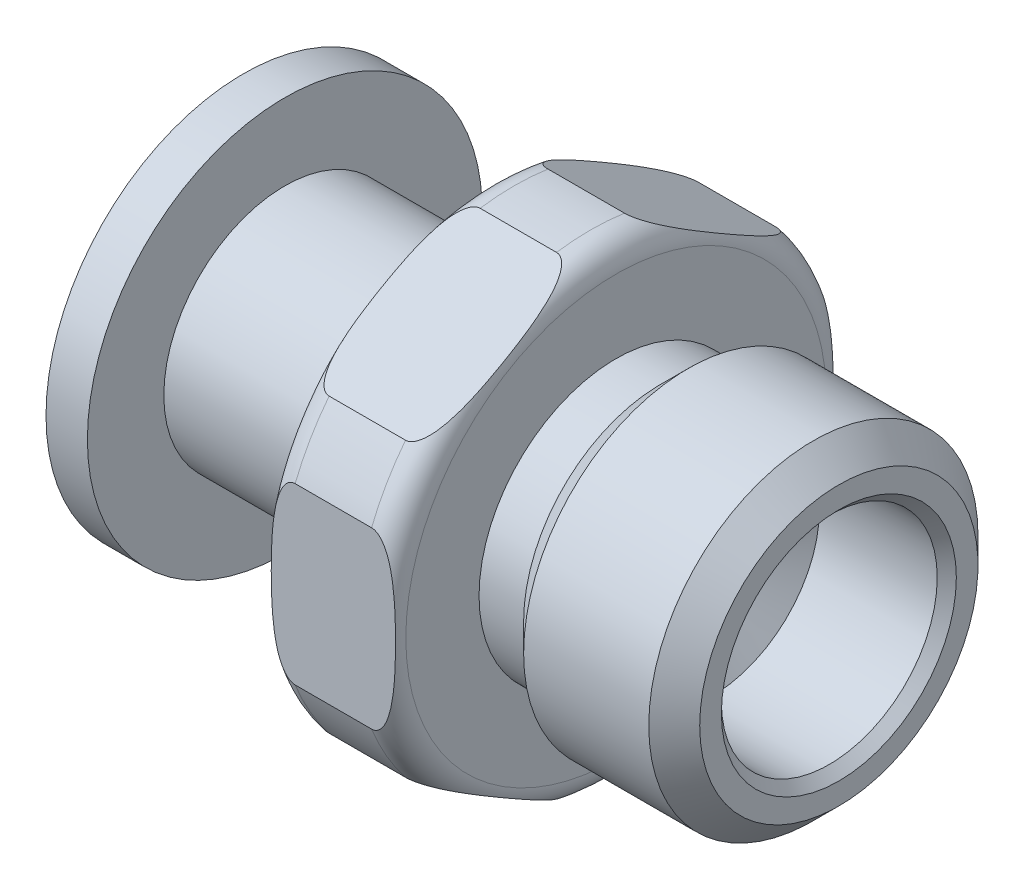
ISO-10303-21;
HEADER;
FILE_DESCRIPTION(('STEP AP214'),'2;1');
FILE_NAME('part.step','',(''),(''),'','','');
FILE_SCHEMA(('AUTOMOTIVE_DESIGN { 1 0 10303 214 1 1 1 1 }'));
ENDSEC;
DATA;
#1=APPLICATION_CONTEXT('core data for automotive mechanical design processes');
#2=APPLICATION_PROTOCOL_DEFINITION('international standard','automotive_design',2000,#1);
#3=PRODUCT_CONTEXT('',#1,'mechanical');
#4=PRODUCT('Part','Part','',(#3));
#5=PRODUCT_RELATED_PRODUCT_CATEGORY('part','',(#4));
#6=PRODUCT_DEFINITION_FORMATION('','',#4);
#7=PRODUCT_DEFINITION_CONTEXT('part definition',#1,'design');
#8=PRODUCT_DEFINITION('design','',#6,#7);
#9=PRODUCT_DEFINITION_SHAPE('','',#8);
#10=(LENGTH_UNIT() NAMED_UNIT(*) SI_UNIT(.MILLI.,.METRE.));
#11=(NAMED_UNIT(*) PLANE_ANGLE_UNIT() SI_UNIT($,.RADIAN.));
#12=(NAMED_UNIT(*) SI_UNIT($,.STERADIAN.) SOLID_ANGLE_UNIT());
#13=UNCERTAINTY_MEASURE_WITH_UNIT(LENGTH_MEASURE(1.E-05),#10,'distance_accuracy_value','');
#14=(GEOMETRIC_REPRESENTATION_CONTEXT(3) GLOBAL_UNCERTAINTY_ASSIGNED_CONTEXT((#13)) GLOBAL_UNIT_ASSIGNED_CONTEXT((#10,
#11,#12)) REPRESENTATION_CONTEXT('',''));
#15=CARTESIAN_POINT('',(0.,0.,0.));
#16=DIRECTION('',(0.,0.,1.));
#17=DIRECTION('',(1.,0.,0.));
#18=AXIS2_PLACEMENT_3D('',#15,#16,#17);
#19=CARTESIAN_POINT('',(0.,0.,0.));
#20=DIRECTION('',(-1.,0.,0.));
#21=DIRECTION('',(0.,0.,1.));
#22=AXIS2_PLACEMENT_3D('',#19,#20,#21);
#23=CYLINDRICAL_SURFACE('',#22,9.398);
#24=CARTESIAN_POINT('',(13.843,0.,0.));
#25=DIRECTION('',(-1.,0.,0.));
#26=DIRECTION('',(0.,0.,1.));
#27=AXIS2_PLACEMENT_3D('',#24,#25,#26);
#28=CIRCLE('',#27,9.398);
#29=CARTESIAN_POINT('',(13.843,9.29985117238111,1.35468526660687));
#30=VERTEX_POINT('',#29);
#31=CARTESIAN_POINT('',(13.843,9.29985117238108,-1.35468526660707));
#32=VERTEX_POINT('',#31);
#33=EDGE_CURVE('E161',#30,#32,#28,.T.);
#34=ORIENTED_EDGE('',*,*,#33,.T.);
#35=DIRECTION('',(-1.,0.,0.));
#36=VECTOR('',#35,1.);
#37=CARTESIAN_POINT('',(0.,9.29985117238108,-1.35468526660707));
#38=LINE('',#37,#36);
#39=CARTESIAN_POINT('',(10.795,9.29985117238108,-1.35468526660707));
#40=VERTEX_POINT('',#39);
#41=EDGE_CURVE('E37',#32,#40,#38,.T.);
#42=ORIENTED_EDGE('',*,*,#41,.T.);
#43=CARTESIAN_POINT('',(10.795,0.,0.));
#44=DIRECTION('',(-1.,0.,0.));
#45=DIRECTION('',(0.,0.,1.));
#46=AXIS2_PLACEMENT_3D('',#43,#44,#45);
#47=CIRCLE('',#46,9.398);
#48=CARTESIAN_POINT('',(10.795,9.29985117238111,1.35468526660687));
#49=VERTEX_POINT('',#48);
#50=EDGE_CURVE('E188',#49,#40,#47,.T.);
#51=ORIENTED_EDGE('',*,*,#50,.F.);
#52=DIRECTION('',(-1.,0.,0.));
#53=VECTOR('',#52,1.);
#54=CARTESIAN_POINT('',(0.,9.29985117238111,1.35468526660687));
#55=LINE('',#54,#53);
#56=EDGE_CURVE('E729',#49,#30,#55,.F.);
#57=ORIENTED_EDGE('',*,*,#56,.T.);
#58=EDGE_LOOP('',(#34,#42,#51,#57));
#59=FACE_BOUND('',#58,.T.);
#60=ADVANCED_FACE('F16',(#59),#23,.T.);
#61=CARTESIAN_POINT('',(13.8429999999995,3.47673373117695,8.73124999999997));
#62=VERTEX_POINT('',#61);
#63=CARTESIAN_POINT('',(13.843,5.82311744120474,7.37656473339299));
#64=VERTEX_POINT('',#63);
#65=EDGE_CURVE('E171',#62,#64,#28,.T.);
#66=ORIENTED_EDGE('',*,*,#65,.T.);
#67=DIRECTION('',(-1.,0.,0.));
#68=VECTOR('',#67,1.);
#69=CARTESIAN_POINT('',(0.,5.82311744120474,7.37656473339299));
#70=LINE('',#69,#68);
#71=CARTESIAN_POINT('',(10.795,5.82311744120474,7.37656473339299));
#72=VERTEX_POINT('',#71);
#73=EDGE_CURVE('E47',#64,#72,#70,.T.);
#74=ORIENTED_EDGE('',*,*,#73,.T.);
#75=CARTESIAN_POINT('',(10.795,3.47673373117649,8.73124999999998));
#76=VERTEX_POINT('',#75);
#77=EDGE_CURVE('E670',#76,#72,#47,.T.);
#78=ORIENTED_EDGE('',*,*,#77,.F.);
#79=DIRECTION('',(-1.,0.,0.));
#80=VECTOR('',#79,1.);
#81=CARTESIAN_POINT('',(0.,3.47673373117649,8.73124999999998));
#82=LINE('',#81,#80);
#83=EDGE_CURVE('E220',#76,#62,#82,.F.);
#84=ORIENTED_EDGE('',*,*,#83,.T.);
#85=EDGE_LOOP('',(#66,#74,#78,#84));
#86=FACE_BOUND('',#85,.T.);
#87=ADVANCED_FACE('F217',(#86),#23,.T.);
#88=CARTESIAN_POINT('',(13.843,-5.82311744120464,7.37656473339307));
#89=VERTEX_POINT('',#88);
#90=CARTESIAN_POINT('',(13.843,-3.47673373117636,8.73125000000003));
#91=VERTEX_POINT('',#90);
#92=EDGE_CURVE('E192',#89,#91,#28,.T.);
#93=ORIENTED_EDGE('',*,*,#92,.T.);
#94=DIRECTION('',(-1.,0.,0.));
#95=VECTOR('',#94,1.);
#96=CARTESIAN_POINT('',(0.,-3.47673373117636,8.73125000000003));
#97=LINE('',#96,#95);
#98=CARTESIAN_POINT('',(10.795,-3.47673373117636,8.73125000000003));
#99=VERTEX_POINT('',#98);
#100=EDGE_CURVE('E320',#91,#99,#97,.T.);
#101=ORIENTED_EDGE('',*,*,#100,.T.);
#102=CARTESIAN_POINT('',(10.795,-5.82311744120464,7.37656473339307));
#103=VERTEX_POINT('',#102);
#104=EDGE_CURVE('E666',#103,#99,#47,.T.);
#105=ORIENTED_EDGE('',*,*,#104,.F.);
#106=DIRECTION('',(-1.,0.,0.));
#107=VECTOR('',#106,1.);
#108=CARTESIAN_POINT('',(0.,-5.82311744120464,7.37656473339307));
#109=LINE('',#108,#107);
#110=EDGE_CURVE('E319',#103,#89,#109,.F.);
#111=ORIENTED_EDGE('',*,*,#110,.T.);
#112=EDGE_LOOP('',(#93,#101,#105,#111));
#113=FACE_BOUND('',#112,.T.);
#114=ADVANCED_FACE('F417',(#113),#23,.T.);
#115=CARTESIAN_POINT('',(13.843,-9.29985117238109,-1.35468526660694));
#116=VERTEX_POINT('',#115);
#117=CARTESIAN_POINT('',(13.843,-9.29985117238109,1.35468526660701));
#118=VERTEX_POINT('',#117);
#119=EDGE_CURVE('E179',#116,#118,#28,.T.);
#120=ORIENTED_EDGE('',*,*,#119,.T.);
#121=DIRECTION('',(-1.,0.,0.));
#122=VECTOR('',#121,1.);
#123=CARTESIAN_POINT('',(0.,-9.29985117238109,1.35468526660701));
#124=LINE('',#123,#122);
#125=CARTESIAN_POINT('',(10.795,-9.29985117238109,1.35468526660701));
#126=VERTEX_POINT('',#125);
#127=EDGE_CURVE('E322',#118,#126,#124,.T.);
#128=ORIENTED_EDGE('',*,*,#127,.T.);
#129=CARTESIAN_POINT('',(10.795,-9.2998511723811,-1.35468526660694));
#130=VERTEX_POINT('',#129);
#131=EDGE_CURVE('E662',#130,#126,#47,.T.);
#132=ORIENTED_EDGE('',*,*,#131,.F.);
#133=DIRECTION('',(-1.,0.,0.));
#134=VECTOR('',#133,1.);
#135=CARTESIAN_POINT('',(0.,-9.2998511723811,-1.35468526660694));
#136=LINE('',#135,#134);
#137=EDGE_CURVE('E330',#130,#116,#136,.F.);
#138=ORIENTED_EDGE('',*,*,#137,.T.);
#139=EDGE_LOOP('',(#120,#128,#132,#138));
#140=FACE_BOUND('',#139,.T.);
#141=ADVANCED_FACE('F426',(#140),#23,.T.);
#142=CARTESIAN_POINT('',(13.8429999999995,-3.47673373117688,-8.73125));
#143=VERTEX_POINT('',#142);
#144=CARTESIAN_POINT('',(13.843,-5.82311744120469,-7.37656473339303));
#145=VERTEX_POINT('',#144);
#146=EDGE_CURVE('E164',#143,#145,#28,.T.);
#147=ORIENTED_EDGE('',*,*,#146,.T.);
#148=DIRECTION('',(-1.,0.,0.));
#149=VECTOR('',#148,1.);
#150=CARTESIAN_POINT('',(0.,-5.82311744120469,-7.37656473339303));
#151=LINE('',#150,#149);
#152=CARTESIAN_POINT('',(10.795,-5.82311744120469,-7.37656473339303));
#153=VERTEX_POINT('',#152);
#154=EDGE_CURVE('E339',#145,#153,#151,.T.);
#155=ORIENTED_EDGE('',*,*,#154,.T.);
#156=CARTESIAN_POINT('',(10.795,-3.47673373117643,-8.73125));
#157=VERTEX_POINT('',#156);
#158=EDGE_CURVE('E189',#157,#153,#47,.T.);
#159=ORIENTED_EDGE('',*,*,#158,.F.);
#160=DIRECTION('',(-1.,0.,0.));
#161=VECTOR('',#160,1.);
#162=CARTESIAN_POINT('',(0.,-3.47673373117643,-8.73125));
#163=LINE('',#162,#161);
#164=EDGE_CURVE('E352',#157,#143,#163,.F.);
#165=ORIENTED_EDGE('',*,*,#164,.T.);
#166=EDGE_LOOP('',(#147,#155,#159,#165));
#167=FACE_BOUND('',#166,.T.);
#168=ADVANCED_FACE('F419',(#167),#23,.T.);
#169=CARTESIAN_POINT('',(0.,0.,0.));
#170=DIRECTION('',(1.,0.,0.));
#171=DIRECTION('',(0.,0.,-1.));
#172=AXIS2_PLACEMENT_3D('',#169,#170,#171);
#173=PLANE('',#172);
#174=CARTESIAN_POINT('',(0.,0.,0.));
#175=DIRECTION('',(-1.,0.,0.));
#176=DIRECTION('',(0.,0.,1.));
#177=AXIS2_PLACEMENT_3D('',#174,#175,#176);
#178=CIRCLE('',#177,2.7686);
#179=CARTESIAN_POINT('',(0.,0.,2.7686));
#180=VERTEX_POINT('',#179);
#181=EDGE_CURVE('E499',#180,#180,#178,.T.);
#182=ORIENTED_EDGE('',*,*,#181,.F.);
#183=EDGE_LOOP('',(#182));
#184=FACE_BOUND('',#183,.T.);
#185=CARTESIAN_POINT('',(0.,0.,0.));
#186=DIRECTION('',(-1.,0.,0.));
#187=DIRECTION('',(0.,0.,1.));
#188=AXIS2_PLACEMENT_3D('',#185,#186,#187);
#189=CIRCLE('',#188,7.87399999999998);
#190=CARTESIAN_POINT('',(0.,0.,7.87399999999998));
#191=VERTEX_POINT('',#190);
#192=EDGE_CURVE('E626',#191,#191,#189,.T.);
#193=ORIENTED_EDGE('',*,*,#192,.T.);
#194=EDGE_LOOP('',(#193));
#195=FACE_BOUND('',#194,.T.);
#196=ADVANCED_FACE('F425',(#184,#195),#173,.F.);
#197=CARTESIAN_POINT('',(0.,0.,0.));
#198=DIRECTION('',(-1.,0.,0.));
#199=DIRECTION('',(0.,0.,1.));
#200=AXIS2_PLACEMENT_3D('',#197,#198,#199);
#201=CYLINDRICAL_SURFACE('',#200,7.87399999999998);
#202=ORIENTED_EDGE('',*,*,#192,.F.);
#203=EDGE_LOOP('',(#202));
#204=FACE_BOUND('',#203,.T.);
#205=CARTESIAN_POINT('',(1.651,0.,0.));
#206=DIRECTION('',(-1.,0.,0.));
#207=DIRECTION('',(0.,0.,1.));
#208=AXIS2_PLACEMENT_3D('',#205,#206,#207);
#209=CIRCLE('',#208,7.87399999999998);
#210=CARTESIAN_POINT('',(1.651,0.,7.87399999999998));
#211=VERTEX_POINT('',#210);
#212=EDGE_CURVE('E633',#211,#211,#209,.T.);
#213=ORIENTED_EDGE('',*,*,#212,.T.);
#214=EDGE_LOOP('',(#213));
#215=FACE_BOUND('',#214,.T.);
#216=ADVANCED_FACE('F432',(#204,#215),#201,.T.);
#217=CARTESIAN_POINT('',(1.651,7.87399999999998,0.));
#218=DIRECTION('',(-1.,0.,0.));
#219=DIRECTION('',(0.,0.,1.));
#220=AXIS2_PLACEMENT_3D('',#217,#218,#219);
#221=PLANE('',#220);
#222=ORIENTED_EDGE('',*,*,#212,.F.);
#223=EDGE_LOOP('',(#222));
#224=FACE_BOUND('',#223,.T.);
#225=CARTESIAN_POINT('',(1.651,0.,0.));
#226=DIRECTION('',(-1.,0.,0.));
#227=DIRECTION('',(0.,0.,1.));
#228=AXIS2_PLACEMENT_3D('',#225,#226,#227);
#229=CIRCLE('',#228,4.826);
#230=CARTESIAN_POINT('',(1.651,0.,4.826));
#231=VERTEX_POINT('',#230);
#232=EDGE_CURVE('E640',#231,#231,#229,.T.);
#233=ORIENTED_EDGE('',*,*,#232,.T.);
#234=EDGE_LOOP('',(#233));
#235=FACE_BOUND('',#234,.T.);
#236=ADVANCED_FACE('F897',(#224,#235),#221,.F.);
#237=CARTESIAN_POINT('',(0.,0.,0.));
#238=DIRECTION('',(-1.,0.,0.));
#239=DIRECTION('',(0.,0.,1.));
#240=AXIS2_PLACEMENT_3D('',#237,#238,#239);
#241=CYLINDRICAL_SURFACE('',#240,4.826);
#242=ORIENTED_EDGE('',*,*,#232,.F.);
#243=EDGE_LOOP('',(#242));
#244=FACE_BOUND('',#243,.T.);
#245=CARTESIAN_POINT('',(9.77900000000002,0.,0.));
#246=DIRECTION('',(-1.,0.,0.));
#247=DIRECTION('',(0.,0.,1.));
#248=AXIS2_PLACEMENT_3D('',#245,#246,#247);
#249=CIRCLE('',#248,4.826);
#250=CARTESIAN_POINT('',(9.77900000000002,0.,4.826));
#251=VERTEX_POINT('',#250);
#252=EDGE_CURVE('E646',#251,#251,#249,.T.);
#253=ORIENTED_EDGE('',*,*,#252,.T.);
#254=EDGE_LOOP('',(#253));
#255=FACE_BOUND('',#254,.T.);
#256=ADVANCED_FACE('F747',(#244,#255),#241,.T.);
#257=CARTESIAN_POINT('',(9.77900000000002,4.826,0.));
#258=DIRECTION('',(1.,0.,0.));
#259=DIRECTION('',(0.,0.,-1.));
#260=AXIS2_PLACEMENT_3D('',#257,#258,#259);
#261=PLANE('',#260);
#262=ORIENTED_EDGE('',*,*,#252,.F.);
#263=EDGE_LOOP('',(#262));
#264=FACE_BOUND('',#263,.T.);
#265=CARTESIAN_POINT('',(9.77900000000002,0.,0.));
#266=DIRECTION('',(-1.,0.,0.));
#267=DIRECTION('',(0.,0.,1.));
#268=AXIS2_PLACEMENT_3D('',#265,#266,#267);
#269=CIRCLE('',#268,8.382);
#270=CARTESIAN_POINT('',(9.77900000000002,0.,8.382));
#271=VERTEX_POINT('',#270);
#272=EDGE_CURVE('E652',#271,#271,#269,.T.);
#273=ORIENTED_EDGE('',*,*,#272,.T.);
#274=EDGE_LOOP('',(#273));
#275=FACE_BOUND('',#274,.T.);
#276=ADVANCED_FACE('F277',(#264,#275),#261,.F.);
#277=CARTESIAN_POINT('',(10.795,0.,0.));
#278=DIRECTION('',(-1.,0.,0.));
#279=DIRECTION('',(0.,0.,1.));
#280=AXIS2_PLACEMENT_3D('',#277,#278,#279);
#281=TOROIDAL_SURFACE('',#280,8.382,1.016);
#282=ORIENTED_EDGE('',*,*,#272,.F.);
#283=EDGE_LOOP('',(#282));
#284=FACE_BOUND('',#283,.T.);
#285=ORIENTED_EDGE('',*,*,#50,.T.);
#286=CARTESIAN_POINT('',(10.7952,9.29985114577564,-1.35468531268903));
#287=CARTESIAN_POINT('',(10.771745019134,9.29988902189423,-1.35461970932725));
#288=CARTESIAN_POINT('',(10.7483713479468,9.29876754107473,-1.35656217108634));
#289=CARTESIAN_POINT('',(10.7026513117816,9.2944988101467,-1.36395582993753));
#290=CARTESIAN_POINT('',(10.6802960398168,9.29137579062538,-1.36936505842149));
#291=CARTESIAN_POINT('',(10.6320416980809,9.28249191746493,-1.38475237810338));
#292=CARTESIAN_POINT('',(10.6064673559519,9.27629749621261,-1.39548143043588));
#293=CARTESIAN_POINT('',(10.5575774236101,9.26191614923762,-1.42039065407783));
#294=CARTESIAN_POINT('',(10.5342735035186,9.25371961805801,-1.43458746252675));
#295=CARTESIAN_POINT('',(10.4770502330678,9.23067223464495,-1.47450670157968));
#296=CARTESIAN_POINT('',(10.4449007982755,9.21473450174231,-1.50211166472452));
#297=CARTESIAN_POINT('',(10.3856308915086,9.18071287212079,-1.56103885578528));
#298=CARTESIAN_POINT('',(10.358519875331,9.16262504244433,-1.59236789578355));
#299=CARTESIAN_POINT('',(10.3082421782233,9.12500279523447,-1.65753153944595));
#300=CARTESIAN_POINT('',(10.2850982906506,9.10546088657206,-1.69137911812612));
#301=CARTESIAN_POINT('',(10.2421415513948,9.06547189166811,-1.76064208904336));
#302=CARTESIAN_POINT('',(10.2223322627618,9.04502386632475,-1.79605910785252));
#303=CARTESIAN_POINT('',(10.1854192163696,9.0034688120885,-1.86803457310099));
#304=CARTESIAN_POINT('',(10.1683227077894,8.98236019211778,-1.90459577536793));
#305=CARTESIAN_POINT('',(10.1364505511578,8.93972931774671,-1.97843461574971));
#306=CARTESIAN_POINT('',(10.1216735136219,8.91820731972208,-2.01571180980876));
#307=CARTESIAN_POINT('',(10.0781448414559,8.84989634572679,-2.13402988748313));
#308=CARTESIAN_POINT('',(10.0528953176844,8.80254984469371,-2.21603643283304));
#309=CARTESIAN_POINT('',(10.0088030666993,8.70710433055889,-2.38135291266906));
#310=CARTESIAN_POINT('',(9.9899669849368,8.65900459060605,-2.46466410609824));
#311=CARTESIAN_POINT('',(9.95705697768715,8.56225176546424,-2.63224491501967));
#312=CARTESIAN_POINT('',(9.94299817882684,8.51359741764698,-2.71651671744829));
#313=CARTESIAN_POINT('',(9.91856501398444,8.41605638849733,-2.88546273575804));
#314=CARTESIAN_POINT('',(9.90819132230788,8.3671696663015,-2.97013702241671));
#315=CARTESIAN_POINT('',(9.89024290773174,8.26899744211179,-3.14017630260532));
#316=CARTESIAN_POINT('',(9.88268404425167,8.21971123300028,-3.22554252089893));
#317=CARTESIAN_POINT('',(9.86981687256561,8.12106323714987,-3.39640586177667));
#318=CARTESIAN_POINT('',(9.86450876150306,8.07170144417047,-3.48190299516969));
#319=CARTESIAN_POINT('',(9.85569480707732,7.97302771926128,-3.65281090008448));
#320=CARTESIAN_POINT('',(9.8521857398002,7.92371585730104,-3.73822155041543));
#321=CARTESIAN_POINT('',(9.84664234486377,7.82507172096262,-3.90907820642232));
#322=CARTESIAN_POINT('',(9.84460802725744,7.77573944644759,-3.99452421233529));
#323=CARTESIAN_POINT('',(9.84173856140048,7.67398993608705,-4.17075953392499));
#324=CARTESIAN_POINT('',(9.84098608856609,7.62157213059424,-4.2615498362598));
#325=CARTESIAN_POINT('',(9.8408514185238,7.51673643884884,-4.44313058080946));
#326=CARTESIAN_POINT('',(9.84146921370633,7.46431855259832,-4.53392102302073));
#327=CARTESIAN_POINT('',(9.84413691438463,7.35963992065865,-4.71522973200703));
#328=CARTESIAN_POINT('',(9.84618276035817,7.30737915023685,-4.80574804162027));
#329=CARTESIAN_POINT('',(9.851917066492,7.20288466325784,-4.98673780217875));
#330=CARTESIAN_POINT('',(9.85560537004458,7.15065094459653,-5.0772092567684));
#331=CARTESIAN_POINT('',(9.86671864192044,7.02694212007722,-5.29147922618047));
#332=CARTESIAN_POINT('',(9.87502057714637,6.95548563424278,-5.41524549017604));
#333=CARTESIAN_POINT('',(9.89685849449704,6.81275631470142,-5.66245992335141));
#334=CARTESIAN_POINT('',(9.91039448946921,6.74148348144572,-5.78590809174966));
#335=CARTESIAN_POINT('',(9.93978438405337,6.6211117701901,-5.99439801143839));
#336=CARTESIAN_POINT('',(9.95366503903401,6.57189430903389,-6.07964515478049));
#337=CARTESIAN_POINT('',(9.98630105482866,6.4737677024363,-6.24960542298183));
#338=CARTESIAN_POINT('',(10.0050639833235,6.4248591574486,-6.3343175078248));
#339=CARTESIAN_POINT('',(10.0394296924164,6.34917275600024,-6.46541020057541));
#340=CARTESIAN_POINT('',(10.0527815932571,6.32213994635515,-6.51223240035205));
#341=CARTESIAN_POINT('',(10.0819500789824,6.26841120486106,-6.60529331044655));
#342=CARTESIAN_POINT('',(10.0977660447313,6.24171519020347,-6.6515321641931));
#343=CARTESIAN_POINT('',(10.1323394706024,6.18888170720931,-6.7430424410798));
#344=CARTESIAN_POINT('',(10.1510884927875,6.16274287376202,-6.78831622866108));
#345=CARTESIAN_POINT('',(10.1922428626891,6.11120371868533,-6.87758466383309));
#346=CARTESIAN_POINT('',(10.2146451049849,6.08580279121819,-6.92158036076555));
#347=CARTESIAN_POINT('',(10.2579144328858,6.04232682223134,-6.99688294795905));
#348=CARTESIAN_POINT('',(10.2777738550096,6.02400304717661,-7.02862065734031));
#349=CARTESIAN_POINT('',(10.3206874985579,5.98825874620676,-7.09053160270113));
#350=CARTESIAN_POINT('',(10.3437466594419,5.97083967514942,-7.12070231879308));
#351=CARTESIAN_POINT('',(10.393957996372,5.93725064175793,-7.17888023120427));
#352=CARTESIAN_POINT('',(10.4211482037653,5.9210946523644,-7.2068632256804));
#353=CARTESIAN_POINT('',(10.4802487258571,5.89108344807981,-7.25884415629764));
#354=CARTESIAN_POINT('',(10.5121449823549,5.87722163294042,-7.28285352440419));
#355=CARTESIAN_POINT('',(10.5669273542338,5.85815873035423,-7.31587144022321));
#356=CARTESIAN_POINT('',(10.5881113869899,5.85174239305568,-7.3269848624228));
#357=CARTESIAN_POINT('',(10.6321495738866,5.84060392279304,-7.34627725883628));
#358=CARTESIAN_POINT('',(10.6549978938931,5.83587618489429,-7.35446594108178));
#359=CARTESIAN_POINT('',(10.6972913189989,5.82925198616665,-7.3659393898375));
#360=CARTESIAN_POINT('',(10.716497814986,5.8269775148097,-7.36987888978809));
#361=CARTESIAN_POINT('',(10.7555208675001,5.82389310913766,-7.37522123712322));
#362=CARTESIAN_POINT('',(10.7753409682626,5.82309451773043,-7.37660443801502));
#363=CARTESIAN_POINT('',(10.7952,5.82311746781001,-7.37656468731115));
#364=B_SPLINE_CURVE_WITH_KNOTS('',3,(#286,#287,#288,#289,#290,#291,#292,#293,#294,#295,#296,
#297,#298,#299,#300,#301,#302,#303,#304,#305,#306,#307,#308,#309,#310,#311,#312,#313,#314,#315,
#316,#317,#318,#319,#320,#321,#322,#323,#324,#325,#326,#327,#328,#329,#330,#331,#332,#333,#334,
#335,#336,#337,#338,#339,#340,#341,#342,#343,#344,#345,#346,#347,#348,#349,#350,#351,#352,#353,
#354,#355,#356,#357,#358,#359,#360,#361,#362,#363),.UNSPECIFIED.,.F.,.F.,(4,2,2,2,2,2,2,2,2,2,2,
2,2,2,2,2,2,2,2,2,2,2,2,2,2,2,2,2,2,2,2,2,2,2,2,2,2,2,4),(0.,0.0701236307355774,
0.139413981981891,0.224191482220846,0.309383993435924,0.444438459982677,0.579743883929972,
0.715802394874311,0.852005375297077,0.988566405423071,1.12504531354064,1.4186811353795,
1.71262029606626,2.00748168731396,2.30239700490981,2.59894966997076,2.89552830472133,
3.19157359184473,3.48762089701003,3.80212649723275,4.11663035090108,4.43024378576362,
4.74382732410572,5.17322860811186,5.60263094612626,5.90077760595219,6.19938918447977,
6.36641409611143,6.53339710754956,6.69990828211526,6.86627864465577,6.99120625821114,
7.11632891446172,7.2426823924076,7.3686657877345,7.44274356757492,7.5165731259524,
7.57556855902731,7.63501554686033),.UNSPECIFIED.);
#365=CARTESIAN_POINT('',(10.795,5.82311744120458,-7.37656473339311));
#366=VERTEX_POINT('',#365);
#367=EDGE_CURVE('E733',#40,#366,#364,.T.);
#368=ORIENTED_EDGE('',*,*,#367,.T.);
#369=CARTESIAN_POINT('',(10.795,3.47673373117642,-8.73125));
#370=VERTEX_POINT('',#369);
#371=EDGE_CURVE('E151',#366,#370,#47,.T.);
#372=ORIENTED_EDGE('',*,*,#371,.T.);
#373=CARTESIAN_POINT('',(9.84091382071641,0.,-8.73125));
#374=CARTESIAN_POINT('',(9.8409112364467,-0.169454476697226,-8.73125));
#375=CARTESIAN_POINT('',(9.84267654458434,-0.338910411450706,-8.73125));
#376=CARTESIAN_POINT('',(9.85023784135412,-0.677804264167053,-8.73125));
#377=CARTESIAN_POINT('',(9.85603546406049,-0.847242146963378,-8.73125));
#378=CARTESIAN_POINT('',(9.87323861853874,-1.18651557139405,-8.73125));
#379=CARTESIAN_POINT('',(9.88466533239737,-1.35635018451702,-8.73125));
#380=CARTESIAN_POINT('',(9.90822573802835,-1.61045217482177,-8.73125));
#381=CARTESIAN_POINT('',(9.9171449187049,-1.69501433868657,-8.73125));
#382=CARTESIAN_POINT('',(9.93768308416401,-1.86380589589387,-8.73125));
#383=CARTESIAN_POINT('',(9.94930169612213,-1.94803533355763,-8.73125));
#384=CARTESIAN_POINT('',(9.97608220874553,-2.1168448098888,-8.73125));
#385=CARTESIAN_POINT('',(9.99127997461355,-2.20141926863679,-8.73125));
#386=CARTESIAN_POINT('',(10.0261604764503,-2.36975649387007,-8.73125));
#387=CARTESIAN_POINT('',(10.0458478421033,-2.4535183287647,-8.73125));
#388=CARTESIAN_POINT('',(10.0909497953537,-2.61891088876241,-8.73125));
#389=CARTESIAN_POINT('',(10.1163251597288,-2.70055212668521,-8.73125));
#390=CARTESIAN_POINT('',(10.1748687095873,-2.86093544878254,-8.73125));
#391=CARTESIAN_POINT('',(10.2080182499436,-2.93968395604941,-8.73125));
#392=CARTESIAN_POINT('',(10.2706176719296,-3.06255635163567,-8.73125));
#393=CARTESIAN_POINT('',(10.2966383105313,-3.10840940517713,-8.73125));
#394=CARTESIAN_POINT('',(10.3541114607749,-3.19663834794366,-8.73125));
#395=CARTESIAN_POINT('',(10.38555583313,-3.23901930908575,-8.73125));
#396=CARTESIAN_POINT('',(10.4422236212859,-3.30293938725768,-8.73125));
#397=CARTESIAN_POINT('',(10.465344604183,-3.32632589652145,-8.73125));
#398=CARTESIAN_POINT('',(10.5146459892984,-3.36965861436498,-8.73125));
#399=CARTESIAN_POINT('',(10.5408220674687,-3.38960958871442,-8.73125));
#400=CARTESIAN_POINT('',(10.5894952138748,-3.42021457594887,-8.73125));
#401=CARTESIAN_POINT('',(10.6113059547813,-3.43194786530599,-8.73125));
#402=CARTESIAN_POINT('',(10.6565422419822,-3.45174878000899,-8.73125));
#403=CARTESIAN_POINT('',(10.6799658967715,-3.45982061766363,-8.73125));
#404=CARTESIAN_POINT('',(10.7281622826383,-3.47157142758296,-8.73125));
#405=CARTESIAN_POINT('',(10.7529459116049,-3.47520694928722,-8.73125));
#406=CARTESIAN_POINT('',(10.8027405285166,-3.4774772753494,-8.73125));
#407=CARTESIAN_POINT('',(10.82775140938,-3.47611432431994,-8.73125));
#408=CARTESIAN_POINT('',(10.8735776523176,-3.46910630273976,-8.73125));
#409=CARTESIAN_POINT('',(10.8944928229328,-3.46408300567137,-8.73125));
#410=CARTESIAN_POINT('',(10.9353047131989,-3.45091121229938,-8.73125));
#411=CARTESIAN_POINT('',(10.955200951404,-3.44276125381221,-8.73125));
#412=CARTESIAN_POINT('',(11.0030079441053,-3.41931835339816,-8.73125));
#413=CARTESIAN_POINT('',(11.0301554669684,-3.40247617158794,-8.73125));
#414=CARTESIAN_POINT('',(11.0814836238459,-3.36475816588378,-8.73125));
#415=CARTESIAN_POINT('',(11.1056558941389,-3.3438713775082,-8.73125));
#416=CARTESIAN_POINT('',(11.1674557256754,-3.28349872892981,-8.73125));
#417=CARTESIAN_POINT('',(11.2024448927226,-3.24133995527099,-8.73125));
#418=CARTESIAN_POINT('',(11.2660929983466,-3.15257645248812,-8.73125));
#419=CARTESIAN_POINT('',(11.2947372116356,-3.10596173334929,-8.73125));
#420=CARTESIAN_POINT('',(11.3559510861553,-2.99393159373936,-8.73125));
#421=CARTESIAN_POINT('',(11.3865899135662,-2.92747482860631,-8.73125));
#422=CARTESIAN_POINT('',(11.4414877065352,-2.79193112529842,-8.73125));
#423=CARTESIAN_POINT('',(11.4657337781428,-2.72283918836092,-8.73125));
#424=CARTESIAN_POINT('',(11.5094568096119,-2.58273077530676,-8.73125));
#425=CARTESIAN_POINT('',(11.5289041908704,-2.51170521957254,-8.73125));
#426=CARTESIAN_POINT('',(11.563907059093,-2.36880305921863,-8.73125));
#427=CARTESIAN_POINT('',(11.5794666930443,-2.29692744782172,-8.73125));
#428=CARTESIAN_POINT('',(11.6076747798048,-2.15172312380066,-8.73125));
#429=CARTESIAN_POINT('',(11.6202861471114,-2.07838731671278,-8.73125));
#430=CARTESIAN_POINT('',(11.6429619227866,-1.93131883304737,-8.73125));
#431=CARTESIAN_POINT('',(11.6530259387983,-1.85758609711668,-8.73125));
#432=CARTESIAN_POINT('',(11.6801373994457,-1.63591934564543,-8.73125));
#433=CARTESIAN_POINT('',(11.6940877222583,-1.48760897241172,-8.73125));
#434=CARTESIAN_POINT('',(11.7164371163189,-1.19014533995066,-8.73125));
#435=CARTESIAN_POINT('',(11.7248187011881,-1.04099089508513,-8.73125));
#436=CARTESIAN_POINT('',(11.7376007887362,-0.742572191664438,-8.73125));
#437=CARTESIAN_POINT('',(11.742002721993,-0.59330799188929,-8.73125));
#438=CARTESIAN_POINT('',(11.7477623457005,-0.294472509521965,-8.73125));
#439=CARTESIAN_POINT('',(11.7491148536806,-0.144901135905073,-8.73125));
#440=CARTESIAN_POINT('',(11.7490565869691,0.154262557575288,-8.73125));
#441=CARTESIAN_POINT('',(11.7476454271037,0.303854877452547,-8.73125));
#442=CARTESIAN_POINT('',(11.741754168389,0.602678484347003,-8.73125));
#443=CARTESIAN_POINT('',(11.7372803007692,0.751909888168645,-8.73125));
#444=CARTESIAN_POINT('',(11.724340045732,1.05018810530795,-8.73125));
#445=CARTESIAN_POINT('',(11.7158743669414,1.19923494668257,-8.73125));
#446=CARTESIAN_POINT('',(11.6959538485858,1.46146373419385,-8.73125));
#447=CARTESIAN_POINT('',(11.685691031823,1.57473355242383,-8.73125));
#448=CARTESIAN_POINT('',(11.6607256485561,1.80089844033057,-8.73125));
#449=CARTESIAN_POINT('',(11.6460193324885,1.91379311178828,-8.73125));
#450=CARTESIAN_POINT('',(11.6106163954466,2.13831974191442,-8.73125));
#451=CARTESIAN_POINT('',(11.589938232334,2.24995450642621,-8.73125));
#452=CARTESIAN_POINT('',(11.5402444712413,2.47126236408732,-8.73125));
#453=CARTESIAN_POINT('',(11.5112412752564,2.58093811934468,-8.73125));
#454=CARTESIAN_POINT('',(11.4484777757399,2.773655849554,-8.73125));
#455=CARTESIAN_POINT('',(11.417031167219,2.85741297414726,-8.73125));
#456=CARTESIAN_POINT('',(11.3618470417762,2.97925933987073,-8.73125));
#457=CARTESIAN_POINT('',(11.342160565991,3.01917263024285,-8.73125));
#458=CARTESIAN_POINT('',(11.2995242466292,3.09719834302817,-8.73125));
#459=CARTESIAN_POINT('',(11.2765781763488,3.13531278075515,-8.73125));
#460=CARTESIAN_POINT('',(11.2329341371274,3.19961212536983,-8.73125));
#461=CARTESIAN_POINT('',(11.2131171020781,3.2263904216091,-8.73125));
#462=CARTESIAN_POINT('',(11.1708071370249,3.27784411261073,-8.73125));
#463=CARTESIAN_POINT('',(11.1483105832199,3.30251658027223,-8.73125));
#464=CARTESIAN_POINT('',(11.0999989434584,3.34902002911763,-8.73125));
#465=CARTESIAN_POINT('',(11.0741491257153,3.37081562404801,-8.73125));
#466=CARTESIAN_POINT('',(11.0190979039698,3.40967235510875,-8.73125));
#467=CARTESIAN_POINT('',(10.9899072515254,3.42674810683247,-8.73125));
#468=CARTESIAN_POINT('',(10.9387233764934,3.44961457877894,-8.73125));
#469=CARTESIAN_POINT('',(10.9175676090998,3.45726972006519,-8.73125));
#470=CARTESIAN_POINT('',(10.8742804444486,3.46898519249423,-8.73125));
#471=CARTESIAN_POINT('',(10.8521500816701,3.47304924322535,-8.73125));
#472=CARTESIAN_POINT('',(10.8074170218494,3.47719765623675,-8.73125));
#473=CARTESIAN_POINT('',(10.7848127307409,3.47726522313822,-8.73125));
#474=CARTESIAN_POINT('',(10.7399525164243,3.47337048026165,-8.73125));
#475=CARTESIAN_POINT('',(10.7176967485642,3.46940642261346,-8.73125));
#476=CARTESIAN_POINT('',(10.6752002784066,3.45811857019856,-8.73125));
#477=CARTESIAN_POINT('',(10.6549140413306,3.45096192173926,-8.73125));
#478=CARTESIAN_POINT('',(10.6155591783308,3.43387917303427,-8.73125));
#479=CARTESIAN_POINT('',(10.5964910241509,3.42395200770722,-8.73125));
#480=CARTESIAN_POINT('',(10.5473430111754,3.39445317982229,-8.73125));
#481=CARTESIAN_POINT('',(10.5184665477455,3.37288143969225,-8.73125));
#482=CARTESIAN_POINT('',(10.4643477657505,3.32557848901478,-8.73125));
#483=CARTESIAN_POINT('',(10.4391174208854,3.29983413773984,-8.73125));
#484=CARTESIAN_POINT('',(10.3725948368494,3.22353986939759,-8.73125));
#485=CARTESIAN_POINT('',(10.3349411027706,3.16985315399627,-8.73125));
#486=CARTESIAN_POINT('',(10.2673434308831,3.05790986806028,-8.73125));
#487=CARTESIAN_POINT('',(10.2374205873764,2.99964134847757,-8.73125));
#488=CARTESIAN_POINT('',(10.1905011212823,2.89618240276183,-8.73125));
#489=CARTESIAN_POINT('',(10.1721746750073,2.85158305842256,-8.73125));
#490=CARTESIAN_POINT('',(10.1381328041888,2.76139128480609,-8.73125));
#491=CARTESIAN_POINT('',(10.1224183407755,2.71579849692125,-8.73125));
#492=CARTESIAN_POINT('',(10.0784761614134,2.57783420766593,-8.73125));
#493=CARTESIAN_POINT('',(10.0535131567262,2.48442595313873,-8.73125));
#494=CARTESIAN_POINT('',(10.0097650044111,2.29577008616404,-8.73125));
#495=CARTESIAN_POINT('',(9.99101031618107,2.20051576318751,-8.73125));
#496=CARTESIAN_POINT('',(9.95827350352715,2.00930289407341,-8.73125));
#497=CARTESIAN_POINT('',(9.94428673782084,1.91334512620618,-8.73125));
#498=CARTESIAN_POINT('',(9.91300633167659,1.66644326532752,-8.73125));
#499=CARTESIAN_POINT('',(9.89833505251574,1.51517458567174,-8.73125));
#500=CARTESIAN_POINT('',(9.87491782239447,1.21213947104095,-8.73125));
#501=CARTESIAN_POINT('',(9.86617505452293,1.06037281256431,-8.73125));
#502=CARTESIAN_POINT('',(9.85287891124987,0.757179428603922,-8.73125));
#503=CARTESIAN_POINT('',(9.84831145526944,0.605753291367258,-8.73125));
#504=CARTESIAN_POINT('',(9.84233048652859,0.302885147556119,-8.73125));
#505=CARTESIAN_POINT('',(9.84091613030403,0.151443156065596,-8.73125));
#506=CARTESIAN_POINT('',(9.84091382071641,0.,-8.73125));
#507=B_SPLINE_CURVE_WITH_KNOTS('',3,(#373,#374,#375,#376,#377,#378,#379,#380,#381,#382,#383,
#384,#385,#386,#387,#388,#389,#390,#391,#392,#393,#394,#395,#396,#397,#398,#399,#400,#401,#402,
#403,#404,#405,#406,#407,#408,#409,#410,#411,#412,#413,#414,#415,#416,#417,#418,#419,#420,#421,
#422,#423,#424,#425,#426,#427,#428,#429,#430,#431,#432,#433,#434,#435,#436,#437,#438,#439,#440,
#441,#442,#443,#444,#445,#446,#447,#448,#449,#450,#451,#452,#453,#454,#455,#456,#457,#458,#459,
#460,#461,#462,#463,#464,#465,#466,#467,#468,#469,#470,#471,#472,#473,#474,#475,#476,#477,#478,
#479,#480,#481,#482,#483,#484,#485,#486,#487,#488,#489,#490,#491,#492,#493,#494,#495,#496,#497,
#498,#499,#500,#501,#502,#503,#504,#505,#506),.UNSPECIFIED.,.T.,.F.,(4,2,2,2,2,2,2,2,2,2,2,2,2,
2,2,2,2,2,2,2,2,2,2,2,2,2,2,2,2,2,2,2,2,2,2,2,2,2,2,2,2,2,2,2,2,2,2,2,2,2,2,2,2,2,2,2,2,2,2,2,2,
2,2,2,2,2,4),(0.,0.508353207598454,1.01691254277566,1.52740035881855,1.78246158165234,
2.03748759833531,2.29518687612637,2.55315310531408,2.8093923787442,3.06502327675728,
3.22294173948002,3.38062524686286,3.47905566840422,3.57734842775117,3.65138342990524,
3.7253330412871,3.80000126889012,3.87463597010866,3.93889284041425,4.00317979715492,
4.09847524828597,4.19403274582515,4.35746540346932,4.52127346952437,4.74029140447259,
4.95974776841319,5.18052482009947,5.40106535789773,5.62424638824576,5.84746177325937,
6.29417305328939,6.7422805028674,7.19022680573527,7.63893381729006,8.08770336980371,
8.53556258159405,8.98334231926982,9.32448206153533,9.66591047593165,10.0062946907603,
10.346174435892,10.613966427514,10.7473679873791,10.8806163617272,10.9804254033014,
11.0803709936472,11.1814497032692,11.2822118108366,11.3494425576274,11.4166035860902,
11.4840468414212,11.5515193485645,11.6158119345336,11.6801292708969,11.7876343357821,
11.8954847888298,12.0911055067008,12.2872544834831,12.4318135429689,12.576425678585,
12.8661340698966,13.1572434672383,13.4480686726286,13.9038095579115,14.3597949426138,
14.8142368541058,15.2685571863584),.UNSPECIFIED.);
#508=EDGE_CURVE('E283',#370,#157,#507,.T.);
#509=ORIENTED_EDGE('',*,*,#508,.T.);
#510=ORIENTED_EDGE('',*,*,#158,.T.);
#511=CARTESIAN_POINT('',(10.7952,-5.82311746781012,-7.37656468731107));
#512=CARTESIAN_POINT('',(10.771745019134,-5.82307959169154,-7.37663029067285));
#513=CARTESIAN_POINT('',(10.7483713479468,-5.82420107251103,-7.37468782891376));
#514=CARTESIAN_POINT('',(10.7026513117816,-5.82846980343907,-7.36729417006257));
#515=CARTESIAN_POINT('',(10.6802960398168,-5.83159282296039,-7.36188494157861));
#516=CARTESIAN_POINT('',(10.6320416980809,-5.84047669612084,-7.34649762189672));
#517=CARTESIAN_POINT('',(10.6064673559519,-5.84667111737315,-7.33576856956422));
#518=CARTESIAN_POINT('',(10.5575774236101,-5.86105246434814,-7.31085934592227));
#519=CARTESIAN_POINT('',(10.5342735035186,-5.86924899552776,-7.29666253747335));
#520=CARTESIAN_POINT('',(10.4770502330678,-5.89229637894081,-7.25674329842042));
#521=CARTESIAN_POINT('',(10.4449007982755,-5.90823411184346,-7.22913833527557));
#522=CARTESIAN_POINT('',(10.3856308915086,-5.94225574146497,-7.17021114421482));
#523=CARTESIAN_POINT('',(10.358519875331,-5.96034357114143,-7.13888210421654));
#524=CARTESIAN_POINT('',(10.3082421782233,-5.99796581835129,-7.07371846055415));
#525=CARTESIAN_POINT('',(10.2850982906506,-6.0175077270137,-7.03987088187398));
#526=CARTESIAN_POINT('',(10.2421415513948,-6.05749672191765,-6.97060791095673));
#527=CARTESIAN_POINT('',(10.2223322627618,-6.07794474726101,-6.93519089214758));
#528=CARTESIAN_POINT('',(10.1854192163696,-6.11949980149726,-6.8632154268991));
#529=CARTESIAN_POINT('',(10.1683227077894,-6.14060842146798,-6.82665422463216));
#530=CARTESIAN_POINT('',(10.1364505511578,-6.18323929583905,-6.75281538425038));
#531=CARTESIAN_POINT('',(10.1216735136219,-6.20476129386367,-6.71553819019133));
#532=CARTESIAN_POINT('',(10.0781448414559,-6.27307226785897,-6.59722011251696));
#533=CARTESIAN_POINT('',(10.0528953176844,-6.32041876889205,-6.51521356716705));
#534=CARTESIAN_POINT('',(10.0088030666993,-6.41586428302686,-6.34989708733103));
#535=CARTESIAN_POINT('',(9.98996698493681,-6.46396402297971,-6.26658589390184));
#536=CARTESIAN_POINT('',(9.95705697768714,-6.56071684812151,-6.09900508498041));
#537=CARTESIAN_POINT('',(9.94299817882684,-6.60937119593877,-6.01473328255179));
#538=CARTESIAN_POINT('',(9.91856501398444,-6.70691222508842,-5.84578726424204));
#539=CARTESIAN_POINT('',(9.90819132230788,-6.75579894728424,-5.76111297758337));
#540=CARTESIAN_POINT('',(9.89024290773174,-6.85397117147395,-5.59107369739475));
#541=CARTESIAN_POINT('',(9.88268404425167,-6.90325738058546,-5.50570747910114));
#542=CARTESIAN_POINT('',(9.86981687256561,-7.00190537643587,-5.3348441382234));
#543=CARTESIAN_POINT('',(9.86450876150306,-7.05126716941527,-5.24934700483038));
#544=CARTESIAN_POINT('',(9.85569480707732,-7.14994089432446,-5.07843909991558));
#545=CARTESIAN_POINT('',(9.8521857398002,-7.1992527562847,-4.99302844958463));
#546=CARTESIAN_POINT('',(9.84664234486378,-7.29789689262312,-4.82217179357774));
#547=CARTESIAN_POINT('',(9.84460802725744,-7.34722916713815,-4.73672578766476));
#548=CARTESIAN_POINT('',(9.84173856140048,-7.44897867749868,-4.56049046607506));
#549=CARTESIAN_POINT('',(9.84098608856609,-7.50139648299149,-4.46970016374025));
#550=CARTESIAN_POINT('',(9.8408514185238,-7.60623217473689,-4.28811941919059));
#551=CARTESIAN_POINT('',(9.84146921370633,-7.65865006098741,-4.19732897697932));
#552=CARTESIAN_POINT('',(9.84413691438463,-7.76332869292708,-4.01602026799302));
#553=CARTESIAN_POINT('',(9.84618276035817,-7.81558946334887,-3.92550195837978));
#554=CARTESIAN_POINT('',(9.851917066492,-7.92008395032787,-3.7445121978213));
#555=CARTESIAN_POINT('',(9.85560537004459,-7.97231766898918,-3.65404074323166));
#556=CARTESIAN_POINT('',(9.86671864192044,-8.09602649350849,-3.43977077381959));
#557=CARTESIAN_POINT('',(9.87502057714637,-8.16748297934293,-3.31600450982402));
#558=CARTESIAN_POINT('',(9.89685849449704,-8.31021229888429,-3.06879007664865));
#559=CARTESIAN_POINT('',(9.91039448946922,-8.38148513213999,-2.94534190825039));
#560=CARTESIAN_POINT('',(9.93978438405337,-8.5018568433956,-2.73685198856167));
#561=CARTESIAN_POINT('',(9.95366503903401,-8.5510743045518,-2.65160484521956));
#562=CARTESIAN_POINT('',(9.98630105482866,-8.64920091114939,-2.48164457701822));
#563=CARTESIAN_POINT('',(10.0050639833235,-8.69810945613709,-2.39693249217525));
#564=CARTESIAN_POINT('',(10.0394296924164,-8.77379585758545,-2.26583979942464));
#565=CARTESIAN_POINT('',(10.0527815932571,-8.80082866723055,-2.219017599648));
#566=CARTESIAN_POINT('',(10.0819500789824,-8.85455740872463,-2.1259566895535));
#567=CARTESIAN_POINT('',(10.0977660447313,-8.88125342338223,-2.07971783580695));
#568=CARTESIAN_POINT('',(10.1323394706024,-8.93408690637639,-1.98820755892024));
#569=CARTESIAN_POINT('',(10.1510884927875,-8.96022573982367,-1.94293377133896));
#570=CARTESIAN_POINT('',(10.1922428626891,-9.01176489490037,-1.85366533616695));
#571=CARTESIAN_POINT('',(10.2146451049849,-9.03716582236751,-1.80966963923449));
#572=CARTESIAN_POINT('',(10.2579144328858,-9.08064179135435,-1.73436705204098));
#573=CARTESIAN_POINT('',(10.2777738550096,-9.09896556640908,-1.70262934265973));
#574=CARTESIAN_POINT('',(10.3206874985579,-9.13470986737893,-1.64071839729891));
#575=CARTESIAN_POINT('',(10.3437466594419,-9.15212893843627,-1.61054768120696));
#576=CARTESIAN_POINT('',(10.3939579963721,-9.18571797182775,-1.55236976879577));
#577=CARTESIAN_POINT('',(10.4211482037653,-9.20187396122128,-1.52438677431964));
#578=CARTESIAN_POINT('',(10.4802487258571,-9.23188516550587,-1.47240584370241));
#579=CARTESIAN_POINT('',(10.5121449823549,-9.24574698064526,-1.44839647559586));
#580=CARTESIAN_POINT('',(10.5669273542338,-9.26480988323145,-1.41537855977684));
#581=CARTESIAN_POINT('',(10.5881113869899,-9.27122622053,-1.40426513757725));
#582=CARTESIAN_POINT('',(10.6321495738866,-9.28236469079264,-1.38497274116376));
#583=CARTESIAN_POINT('',(10.6549978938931,-9.28709242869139,-1.37678405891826));
#584=CARTESIAN_POINT('',(10.6972913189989,-9.29371662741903,-1.36531061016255));
#585=CARTESIAN_POINT('',(10.716497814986,-9.29599109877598,-1.36137111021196));
#586=CARTESIAN_POINT('',(10.7555208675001,-9.29907550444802,-1.35602876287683));
#587=CARTESIAN_POINT('',(10.7753409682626,-9.29987409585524,-1.35464556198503));
#588=CARTESIAN_POINT('',(10.7952,-9.29985114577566,-1.3546853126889));
#589=B_SPLINE_CURVE_WITH_KNOTS('',3,(#511,#512,#513,#514,#515,#516,#517,#518,#519,#520,#521,
#522,#523,#524,#525,#526,#527,#528,#529,#530,#531,#532,#533,#534,#535,#536,#537,#538,#539,#540,
#541,#542,#543,#544,#545,#546,#547,#548,#549,#550,#551,#552,#553,#554,#555,#556,#557,#558,#559,
#560,#561,#562,#563,#564,#565,#566,#567,#568,#569,#570,#571,#572,#573,#574,#575,#576,#577,#578,
#579,#580,#581,#582,#583,#584,#585,#586,#587,#588),.UNSPECIFIED.,.F.,.F.,(4,2,2,2,2,2,2,2,2,2,2,
2,2,2,2,2,2,2,2,2,2,2,2,2,2,2,2,2,2,2,2,2,2,2,2,2,2,2,4),(0.,0.0701236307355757,
0.139413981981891,0.224191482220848,0.309383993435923,0.444438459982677,0.579743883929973,
0.715802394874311,0.852005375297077,0.988566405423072,1.12504531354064,1.4186811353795,
1.71262029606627,2.00748168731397,2.30239700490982,2.59894966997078,2.89552830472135,
3.19157359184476,3.48762089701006,3.80212649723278,4.1166303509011,4.43024378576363,
4.74382732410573,5.17322860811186,5.60263094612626,5.90077760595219,6.19938918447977,
6.36641409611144,6.53339710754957,6.69990828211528,6.86627864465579,6.99120625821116,
7.11632891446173,7.2426823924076,7.3686657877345,7.44274356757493,7.51657312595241,
7.57556855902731,7.63501554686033),.UNSPECIFIED.);
#590=EDGE_CURVE('E294',#153,#130,#589,.T.);
#591=ORIENTED_EDGE('',*,*,#590,.T.);
#592=ORIENTED_EDGE('',*,*,#131,.T.);
#593=CARTESIAN_POINT('',(10.7952,-9.29985114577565,1.35468531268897));
#594=CARTESIAN_POINT('',(10.771745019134,-9.29988902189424,1.35461970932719));
#595=CARTESIAN_POINT('',(10.7483713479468,-9.29876754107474,1.35656217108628));
#596=CARTESIAN_POINT('',(10.7026513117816,-9.29449881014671,1.36395582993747));
#597=CARTESIAN_POINT('',(10.6802960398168,-9.29137579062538,1.36936505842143));
#598=CARTESIAN_POINT('',(10.6320416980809,-9.28249191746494,1.38475237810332));
#599=CARTESIAN_POINT('',(10.6064673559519,-9.27629749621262,1.39548143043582));
#600=CARTESIAN_POINT('',(10.5575774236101,-9.26191614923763,1.42039065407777));
#601=CARTESIAN_POINT('',(10.5342735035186,-9.25371961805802,1.43458746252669));
#602=CARTESIAN_POINT('',(10.4770502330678,-9.23067223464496,1.47450670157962));
#603=CARTESIAN_POINT('',(10.4449007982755,-9.21473450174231,1.50211166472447));
#604=CARTESIAN_POINT('',(10.3856308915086,-9.18071287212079,1.56103885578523));
#605=CARTESIAN_POINT('',(10.358519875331,-9.16262504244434,1.5923678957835));
#606=CARTESIAN_POINT('',(10.3082421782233,-9.12500279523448,1.6575315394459));
#607=CARTESIAN_POINT('',(10.2850982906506,-9.10546088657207,1.69137911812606));
#608=CARTESIAN_POINT('',(10.2421415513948,-9.06547189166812,1.76064208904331));
#609=CARTESIAN_POINT('',(10.2223322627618,-9.04502386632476,1.79605910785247));
#610=CARTESIAN_POINT('',(10.1854192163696,-9.0034688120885,1.86803457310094));
#611=CARTESIAN_POINT('',(10.1683227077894,-8.98236019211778,1.90459577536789));
#612=CARTESIAN_POINT('',(10.1364505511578,-8.93972931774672,1.97843461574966));
#613=CARTESIAN_POINT('',(10.1216735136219,-8.91820731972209,2.01571180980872));
#614=CARTESIAN_POINT('',(10.0781448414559,-8.84989634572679,2.13402988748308));
#615=CARTESIAN_POINT('',(10.0528953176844,-8.80254984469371,2.216036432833));
#616=CARTESIAN_POINT('',(10.0088030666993,-8.7071043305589,2.38135291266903));
#617=CARTESIAN_POINT('',(9.9899669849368,-8.65900459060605,2.46466410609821));
#618=CARTESIAN_POINT('',(9.95705697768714,-8.56225176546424,2.63224491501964));
#619=CARTESIAN_POINT('',(9.94299817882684,-8.51359741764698,2.71651671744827));
#620=CARTESIAN_POINT('',(9.91856501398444,-8.41605638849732,2.88546273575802));
#621=CARTESIAN_POINT('',(9.90819132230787,-8.3671696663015,2.97013702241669));
#622=CARTESIAN_POINT('',(9.89024290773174,-8.26899744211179,3.14017630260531));
#623=CARTESIAN_POINT('',(9.88268404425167,-8.21971123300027,3.22554252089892));
#624=CARTESIAN_POINT('',(9.86981687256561,-8.12106323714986,3.39640586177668));
#625=CARTESIAN_POINT('',(9.86450876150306,-8.07170144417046,3.4819029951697));
#626=CARTESIAN_POINT('',(9.85569480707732,-7.97302771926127,3.6528109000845));
#627=CARTESIAN_POINT('',(9.8521857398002,-7.92371585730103,3.73822155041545));
#628=CARTESIAN_POINT('',(9.84664234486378,-7.8250717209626,3.90907820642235));
#629=CARTESIAN_POINT('',(9.84460802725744,-7.77573944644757,3.99452421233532));
#630=CARTESIAN_POINT('',(9.84173856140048,-7.67398993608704,4.17075953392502));
#631=CARTESIAN_POINT('',(9.84098608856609,-7.62157213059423,4.26154983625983));
#632=CARTESIAN_POINT('',(9.8408514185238,-7.51673643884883,4.44313058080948));
#633=CARTESIAN_POINT('',(9.84146921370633,-7.46431855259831,4.53392102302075));
#634=CARTESIAN_POINT('',(9.84413691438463,-7.35963992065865,4.71522973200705));
#635=CARTESIAN_POINT('',(9.84618276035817,-7.30737915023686,4.80574804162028));
#636=CARTESIAN_POINT('',(9.85191706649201,-7.20288466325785,4.98673780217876));
#637=CARTESIAN_POINT('',(9.85560537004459,-7.15065094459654,5.0772092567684));
#638=CARTESIAN_POINT('',(9.86671864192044,-7.02694212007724,5.29147922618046));
#639=CARTESIAN_POINT('',(9.87502057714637,-6.9554856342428,5.41524549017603));
#640=CARTESIAN_POINT('',(9.89685849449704,-6.81275631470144,5.66245992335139));
#641=CARTESIAN_POINT('',(9.91039448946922,-6.74148348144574,5.78590809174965));
#642=CARTESIAN_POINT('',(9.93978438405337,-6.62111177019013,5.99439801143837));
#643=CARTESIAN_POINT('',(9.95366503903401,-6.57189430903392,6.07964515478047));
#644=CARTESIAN_POINT('',(9.98630105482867,-6.47376770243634,6.24960542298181));
#645=CARTESIAN_POINT('',(10.0050639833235,-6.42485915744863,6.33431750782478));
#646=CARTESIAN_POINT('',(10.0394296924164,-6.34917275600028,6.46541020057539));
#647=CARTESIAN_POINT('',(10.0527815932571,-6.32213994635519,6.51223240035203));
#648=CARTESIAN_POINT('',(10.0819500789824,-6.2684112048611,6.60529331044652));
#649=CARTESIAN_POINT('',(10.0977660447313,-6.24171519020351,6.65153216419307));
#650=CARTESIAN_POINT('',(10.1323394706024,-6.18888170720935,6.74304244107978));
#651=CARTESIAN_POINT('',(10.1510884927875,-6.16274287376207,6.78831622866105));
#652=CARTESIAN_POINT('',(10.1922428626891,-6.11120371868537,6.87758466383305));
#653=CARTESIAN_POINT('',(10.2146451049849,-6.08580279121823,6.92158036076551));
#654=CARTESIAN_POINT('',(10.2579144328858,-6.04232682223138,6.99688294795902));
#655=CARTESIAN_POINT('',(10.2777738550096,-6.02400304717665,7.02862065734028));
#656=CARTESIAN_POINT('',(10.3206874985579,-5.9882587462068,7.09053160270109));
#657=CARTESIAN_POINT('',(10.3437466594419,-5.97083967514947,7.12070231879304));
#658=CARTESIAN_POINT('',(10.3939579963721,-5.93725064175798,7.17888023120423));
#659=CARTESIAN_POINT('',(10.4211482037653,-5.92109465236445,7.20686322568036));
#660=CARTESIAN_POINT('',(10.4802487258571,-5.89108344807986,7.2588441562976));
#661=CARTESIAN_POINT('',(10.5121449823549,-5.87722163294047,7.28285352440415));
#662=CARTESIAN_POINT('',(10.5669273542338,-5.85815873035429,7.31587144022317));
#663=CARTESIAN_POINT('',(10.5881113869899,-5.85174239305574,7.32698486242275));
#664=CARTESIAN_POINT('',(10.6321495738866,-5.8406039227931,7.34627725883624));
#665=CARTESIAN_POINT('',(10.6549978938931,-5.83587618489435,7.35446594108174));
#666=CARTESIAN_POINT('',(10.6972913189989,-5.8292519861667,7.36593938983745));
#667=CARTESIAN_POINT('',(10.716497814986,-5.82697751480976,7.36987888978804));
#668=CARTESIAN_POINT('',(10.7555208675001,-5.82389310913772,7.37522123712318));
#669=CARTESIAN_POINT('',(10.7753409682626,-5.82309451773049,7.37660443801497));
#670=CARTESIAN_POINT('',(10.7952,-5.82311746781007,7.37656468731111));
#671=B_SPLINE_CURVE_WITH_KNOTS('',3,(#593,#594,#595,#596,#597,#598,#599,#600,#601,#602,#603,
#604,#605,#606,#607,#608,#609,#610,#611,#612,#613,#614,#615,#616,#617,#618,#619,#620,#621,#622,
#623,#624,#625,#626,#627,#628,#629,#630,#631,#632,#633,#634,#635,#636,#637,#638,#639,#640,#641,
#642,#643,#644,#645,#646,#647,#648,#649,#650,#651,#652,#653,#654,#655,#656,#657,#658,#659,#660,
#661,#662,#663,#664,#665,#666,#667,#668,#669,#670),.UNSPECIFIED.,.F.,.F.,(4,2,2,2,2,2,2,2,2,2,2,
2,2,2,2,2,2,2,2,2,2,2,2,2,2,2,2,2,2,2,2,2,2,2,2,2,2,2,4),(0.,0.0701236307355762,
0.139413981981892,0.224191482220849,0.309383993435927,0.444438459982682,0.579743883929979,
0.71580239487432,0.852005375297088,0.988566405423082,1.12504531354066,1.41868113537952,
1.71262029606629,2.007481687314,2.30239700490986,2.59894966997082,2.8955283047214,
3.19157359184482,3.48762089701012,3.80212649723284,4.11663035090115,4.43024378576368,
4.74382732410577,5.1732286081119,5.60263094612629,5.90077760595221,6.19938918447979,
6.36641409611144,6.53339710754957,6.69990828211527,6.86627864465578,6.99120625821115,
7.11632891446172,7.24268239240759,7.36866578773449,7.44274356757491,7.51657312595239,
7.5755685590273,7.63501554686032),.UNSPECIFIED.);
#672=EDGE_CURVE('E304',#126,#103,#671,.T.);
#673=ORIENTED_EDGE('',*,*,#672,.T.);
#674=ORIENTED_EDGE('',*,*,#104,.T.);
#675=CARTESIAN_POINT('',(9.84091382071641,0.,8.73125));
#676=CARTESIAN_POINT('',(9.8409112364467,0.169454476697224,8.73125));
#677=CARTESIAN_POINT('',(9.84267654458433,0.338910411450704,8.73125));
#678=CARTESIAN_POINT('',(9.85023784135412,0.67780426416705,8.73125));
#679=CARTESIAN_POINT('',(9.85603546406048,0.847242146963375,8.73125));
#680=CARTESIAN_POINT('',(9.87323861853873,1.18651557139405,8.73124999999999));
#681=CARTESIAN_POINT('',(9.88466533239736,1.35635018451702,8.73124999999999));
#682=CARTESIAN_POINT('',(9.90822573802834,1.61045217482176,8.73124999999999));
#683=CARTESIAN_POINT('',(9.9171449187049,1.69501433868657,8.73124999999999));
#684=CARTESIAN_POINT('',(9.937683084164,1.86380589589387,8.73124999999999));
#685=CARTESIAN_POINT('',(9.94930169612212,1.94803533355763,8.73124999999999));
#686=CARTESIAN_POINT('',(9.97608220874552,2.1168448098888,8.73124999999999));
#687=CARTESIAN_POINT('',(9.99127997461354,2.20141926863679,8.73124999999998));
#688=CARTESIAN_POINT('',(10.0261604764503,2.36975649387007,8.73124999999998));
#689=CARTESIAN_POINT('',(10.0458478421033,2.45351832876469,8.73124999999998));
#690=CARTESIAN_POINT('',(10.0909497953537,2.61891088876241,8.73124999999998));
#691=CARTESIAN_POINT('',(10.1163251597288,2.70055212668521,8.73124999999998));
#692=CARTESIAN_POINT('',(10.1748687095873,2.86093544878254,8.73124999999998));
#693=CARTESIAN_POINT('',(10.2080182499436,2.93968395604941,8.73124999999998));
#694=CARTESIAN_POINT('',(10.2706176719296,3.06255635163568,8.73124999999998));
#695=CARTESIAN_POINT('',(10.2966383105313,3.10840940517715,8.73124999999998));
#696=CARTESIAN_POINT('',(10.3541114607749,3.19663834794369,8.73124999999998));
#697=CARTESIAN_POINT('',(10.3855558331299,3.2390193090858,8.73124999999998));
#698=CARTESIAN_POINT('',(10.4422236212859,3.30293938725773,8.73124999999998));
#699=CARTESIAN_POINT('',(10.465344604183,3.3263258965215,8.73124999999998));
#700=CARTESIAN_POINT('',(10.5146459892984,3.36965861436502,8.73124999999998));
#701=CARTESIAN_POINT('',(10.5408220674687,3.38960958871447,8.73124999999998));
#702=CARTESIAN_POINT('',(10.5894952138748,3.42021457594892,8.73124999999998));
#703=CARTESIAN_POINT('',(10.6113059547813,3.43194786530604,8.73124999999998));
#704=CARTESIAN_POINT('',(10.6565422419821,3.45174878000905,8.73124999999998));
#705=CARTESIAN_POINT('',(10.6799658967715,3.4598206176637,8.73124999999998));
#706=CARTESIAN_POINT('',(10.7281622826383,3.47157142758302,8.73124999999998));
#707=CARTESIAN_POINT('',(10.7529459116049,3.47520694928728,8.73124999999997));
#708=CARTESIAN_POINT('',(10.8027405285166,3.47747727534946,8.73124999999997));
#709=CARTESIAN_POINT('',(10.82775140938,3.47611432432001,8.73124999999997));
#710=CARTESIAN_POINT('',(10.8735776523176,3.46910630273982,8.73124999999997));
#711=CARTESIAN_POINT('',(10.8944928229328,3.46408300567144,8.73124999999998));
#712=CARTESIAN_POINT('',(10.9353047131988,3.45091121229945,8.73124999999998));
#713=CARTESIAN_POINT('',(10.955200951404,3.44276125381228,8.73124999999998));
#714=CARTESIAN_POINT('',(11.0030079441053,3.41931835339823,8.73124999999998));
#715=CARTESIAN_POINT('',(11.0301554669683,3.40247617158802,8.73124999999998));
#716=CARTESIAN_POINT('',(11.0814836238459,3.36475816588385,8.73124999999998));
#717=CARTESIAN_POINT('',(11.1056558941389,3.34387137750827,8.73124999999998));
#718=CARTESIAN_POINT('',(11.1674557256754,3.28349872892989,8.73124999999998));
#719=CARTESIAN_POINT('',(11.2024448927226,3.24133995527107,8.73124999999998));
#720=CARTESIAN_POINT('',(11.2660929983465,3.1525764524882,8.73124999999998));
#721=CARTESIAN_POINT('',(11.2947372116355,3.10596173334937,8.73124999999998));
#722=CARTESIAN_POINT('',(11.3559510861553,2.99393159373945,8.73124999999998));
#723=CARTESIAN_POINT('',(11.3865899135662,2.92747482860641,8.73124999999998));
#724=CARTESIAN_POINT('',(11.4414877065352,2.79193112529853,8.73124999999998));
#725=CARTESIAN_POINT('',(11.4657337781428,2.72283918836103,8.73124999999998));
#726=CARTESIAN_POINT('',(11.5094568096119,2.58273077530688,8.73124999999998));
#727=CARTESIAN_POINT('',(11.5289041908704,2.51170521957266,8.73124999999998));
#728=CARTESIAN_POINT('',(11.5639070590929,2.36880305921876,8.73124999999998));
#729=CARTESIAN_POINT('',(11.5794666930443,2.29692744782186,8.73124999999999));
#730=CARTESIAN_POINT('',(11.6076747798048,2.15172312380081,8.73124999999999));
#731=CARTESIAN_POINT('',(11.6202861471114,2.07838731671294,8.73124999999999));
#732=CARTESIAN_POINT('',(11.6429619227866,1.93131883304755,8.73124999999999));
#733=CARTESIAN_POINT('',(11.6530259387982,1.85758609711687,8.73124999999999));
#734=CARTESIAN_POINT('',(11.6801373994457,1.63591934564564,8.73124999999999));
#735=CARTESIAN_POINT('',(11.6940877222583,1.48760897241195,8.73124999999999));
#736=CARTESIAN_POINT('',(11.7164371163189,1.19014533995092,8.73124999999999));
#737=CARTESIAN_POINT('',(11.7248187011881,1.04099089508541,8.73124999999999));
#738=CARTESIAN_POINT('',(11.7376007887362,0.742572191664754,8.73125));
#739=CARTESIAN_POINT('',(11.742002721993,0.593307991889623,8.73125));
#740=CARTESIAN_POINT('',(11.7477623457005,0.29447250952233,8.73125));
#741=CARTESIAN_POINT('',(11.7491148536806,0.144901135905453,8.73125));
#742=CARTESIAN_POINT('',(11.7490565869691,-0.15426255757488,8.73125));
#743=CARTESIAN_POINT('',(11.7476454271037,-0.303854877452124,8.73125));
#744=CARTESIAN_POINT('',(11.741754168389,-0.602678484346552,8.73125000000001));
#745=CARTESIAN_POINT('',(11.7372803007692,-0.75190988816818,8.73125000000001));
#746=CARTESIAN_POINT('',(11.724340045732,-1.05018810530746,8.73125000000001));
#747=CARTESIAN_POINT('',(11.7158743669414,-1.19923494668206,8.73125000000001));
#748=CARTESIAN_POINT('',(11.6959538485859,-1.46146373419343,8.73125000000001));
#749=CARTESIAN_POINT('',(11.6856910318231,-1.5747335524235,8.73125000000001));
#750=CARTESIAN_POINT('',(11.6607256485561,-1.80089844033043,8.73125000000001));
#751=CARTESIAN_POINT('',(11.6460193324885,-1.91379311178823,8.73125000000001));
#752=CARTESIAN_POINT('',(11.6106163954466,-2.13831974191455,8.73125000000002));
#753=CARTESIAN_POINT('',(11.5899382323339,-2.24995450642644,8.73125000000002));
#754=CARTESIAN_POINT('',(11.5402444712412,-2.47126236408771,8.73125000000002));
#755=CARTESIAN_POINT('',(11.5112412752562,-2.58093811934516,8.73125000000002));
#756=CARTESIAN_POINT('',(11.4484777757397,-2.77365584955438,8.73125000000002));
#757=CARTESIAN_POINT('',(11.4170311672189,-2.85741297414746,8.73125000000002));
#758=CARTESIAN_POINT('',(11.3618470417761,-2.97925933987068,8.73125000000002));
#759=CARTESIAN_POINT('',(11.342160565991,-3.01917263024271,8.73125000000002));
#760=CARTESIAN_POINT('',(11.2995242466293,-3.09719834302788,8.73125000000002));
#761=CARTESIAN_POINT('',(11.276578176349,-3.13531278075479,8.73125000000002));
#762=CARTESIAN_POINT('',(11.2329341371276,-3.19961212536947,8.73125000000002));
#763=CARTESIAN_POINT('',(11.2131171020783,-3.2263904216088,8.73125000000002));
#764=CARTESIAN_POINT('',(11.170807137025,-3.27784411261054,8.73125000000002));
#765=CARTESIAN_POINT('',(11.14831058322,-3.3025165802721,8.73125000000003));
#766=CARTESIAN_POINT('',(11.0999989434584,-3.34902002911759,8.73125000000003));
#767=CARTESIAN_POINT('',(11.0741491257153,-3.37081562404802,8.73125000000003));
#768=CARTESIAN_POINT('',(11.0190979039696,-3.40967235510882,8.73125000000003));
#769=CARTESIAN_POINT('',(10.9899072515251,-3.42674810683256,8.73125000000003));
#770=CARTESIAN_POINT('',(10.938723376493,-3.44961457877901,8.73125000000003));
#771=CARTESIAN_POINT('',(10.9175676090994,-3.45726972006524,8.73125000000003));
#772=CARTESIAN_POINT('',(10.8742804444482,-3.46898519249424,8.73125000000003));
#773=CARTESIAN_POINT('',(10.8521500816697,-3.47304924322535,8.73125000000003));
#774=CARTESIAN_POINT('',(10.807417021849,-3.47719765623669,8.73125000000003));
#775=CARTESIAN_POINT('',(10.7848127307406,-3.47726522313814,8.73125000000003));
#776=CARTESIAN_POINT('',(10.739952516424,-3.47337048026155,8.73125000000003));
#777=CARTESIAN_POINT('',(10.7176967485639,-3.46940642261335,8.73125000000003));
#778=CARTESIAN_POINT('',(10.6752002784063,-3.45811857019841,8.73125000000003));
#779=CARTESIAN_POINT('',(10.6549140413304,-3.4509619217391,8.73125000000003));
#780=CARTESIAN_POINT('',(10.6155591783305,-3.43387917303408,8.73125000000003));
#781=CARTESIAN_POINT('',(10.5964910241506,-3.42395200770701,8.73125000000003));
#782=CARTESIAN_POINT('',(10.5473430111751,-3.39445317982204,8.73125000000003));
#783=CARTESIAN_POINT('',(10.5184665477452,-3.37288143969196,8.73125000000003));
#784=CARTESIAN_POINT('',(10.4643477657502,-3.32557848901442,8.73125000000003));
#785=CARTESIAN_POINT('',(10.4391174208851,-3.29983413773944,8.73125000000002));
#786=CARTESIAN_POINT('',(10.3725948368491,-3.22353986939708,8.73125000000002));
#787=CARTESIAN_POINT('',(10.3349411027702,-3.16985315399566,8.73125000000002));
#788=CARTESIAN_POINT('',(10.2673434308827,-3.0579098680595,8.73125000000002));
#789=CARTESIAN_POINT('',(10.237420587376,-2.9996413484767,8.73125000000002));
#790=CARTESIAN_POINT('',(10.1905011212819,-2.89618240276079,8.73125000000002));
#791=CARTESIAN_POINT('',(10.1721746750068,-2.85158305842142,8.73125000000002));
#792=CARTESIAN_POINT('',(10.1381328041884,-2.76139128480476,8.73125000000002));
#793=CARTESIAN_POINT('',(10.122418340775,-2.71579849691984,8.73125000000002));
#794=CARTESIAN_POINT('',(10.0784761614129,-2.57783420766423,8.73125000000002));
#795=CARTESIAN_POINT('',(10.0535131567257,-2.48442595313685,8.73125000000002));
#796=CARTESIAN_POINT('',(10.0097650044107,-2.29577008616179,8.73125000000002));
#797=CARTESIAN_POINT('',(9.99101031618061,-2.20051576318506,8.73125000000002));
#798=CARTESIAN_POINT('',(9.95827350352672,-2.0093028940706,8.73125000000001));
#799=CARTESIAN_POINT('',(9.94428673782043,-1.91334512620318,8.73125000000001));
#800=CARTESIAN_POINT('',(9.91300633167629,-1.66644326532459,8.73125000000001));
#801=CARTESIAN_POINT('',(9.89833505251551,-1.51517458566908,8.73125000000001));
#802=CARTESIAN_POINT('',(9.87491782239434,-1.21213947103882,8.73125000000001));
#803=CARTESIAN_POINT('',(9.86617505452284,-1.06037281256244,8.73125000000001));
#804=CARTESIAN_POINT('',(9.85287891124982,-0.75717942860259,8.73125000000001));
#805=CARTESIAN_POINT('',(9.84831145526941,-0.605753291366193,8.73125000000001));
#806=CARTESIAN_POINT('',(9.84233048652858,-0.302885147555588,8.73125));
#807=CARTESIAN_POINT('',(9.84091613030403,-0.151443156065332,8.73125));
#808=CARTESIAN_POINT('',(9.84091382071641,0.,8.73125));
#809=B_SPLINE_CURVE_WITH_KNOTS('',3,(#675,#676,#677,#678,#679,#680,#681,#682,#683,#684,#685,
#686,#687,#688,#689,#690,#691,#692,#693,#694,#695,#696,#697,#698,#699,#700,#701,#702,#703,#704,
#705,#706,#707,#708,#709,#710,#711,#712,#713,#714,#715,#716,#717,#718,#719,#720,#721,#722,#723,
#724,#725,#726,#727,#728,#729,#730,#731,#732,#733,#734,#735,#736,#737,#738,#739,#740,#741,#742,
#743,#744,#745,#746,#747,#748,#749,#750,#751,#752,#753,#754,#755,#756,#757,#758,#759,#760,#761,
#762,#763,#764,#765,#766,#767,#768,#769,#770,#771,#772,#773,#774,#775,#776,#777,#778,#779,#780,
#781,#782,#783,#784,#785,#786,#787,#788,#789,#790,#791,#792,#793,#794,#795,#796,#797,#798,#799,
#800,#801,#802,#803,#804,#805,#806,#807,#808),.UNSPECIFIED.,.T.,.F.,(4,2,2,2,2,2,2,2,2,2,2,2,2,
2,2,2,2,2,2,2,2,2,2,2,2,2,2,2,2,2,2,2,2,2,2,2,2,2,2,2,2,2,2,2,2,2,2,2,2,2,2,2,2,2,2,2,2,2,2,2,2,
2,2,2,2,2,4),(0.,0.508353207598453,1.01691254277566,1.52740035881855,1.78246158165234,
2.03748759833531,2.29518687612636,2.55315310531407,2.8093923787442,3.06502327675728,
3.22294173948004,3.38062524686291,3.47905566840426,3.57734842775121,3.65138342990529,
3.72533304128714,3.80000126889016,3.87463597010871,3.93889284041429,4.00317979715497,
4.09847524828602,4.1940327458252,4.35746540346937,4.5212734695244,4.74029140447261,
4.9597477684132,5.18052482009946,5.40106535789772,5.62424638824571,5.8474617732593,
6.29417305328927,6.74228050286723,7.19022680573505,7.63893381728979,8.08770336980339,
8.5355625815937,8.98334231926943,9.32448206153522,9.66591047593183,10.0062946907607,
10.3461744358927,10.6139664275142,10.747367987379,10.8806163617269,10.9804254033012,
11.0803709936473,11.1814497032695,11.282211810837,11.3494425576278,11.4166035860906,
11.4840468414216,11.5515193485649,11.615811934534,11.6801292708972,11.7876343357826,
11.8954847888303,12.0911055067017,12.2872544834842,12.4318135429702,12.5764256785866,
12.8661340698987,13.157243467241,13.4480686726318,13.9038095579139,14.3597949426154,
14.8142368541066,15.2685571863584),.UNSPECIFIED.);
#810=EDGE_CURVE('E312',#99,#76,#809,.T.);
#811=ORIENTED_EDGE('',*,*,#810,.T.);
#812=ORIENTED_EDGE('',*,*,#77,.T.);
#813=CARTESIAN_POINT('',(10.7952,5.82311746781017,7.37656468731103));
#814=CARTESIAN_POINT('',(10.771745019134,5.82307959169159,7.37663029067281));
#815=CARTESIAN_POINT('',(10.7483713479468,5.82420107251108,7.37468782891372));
#816=CARTESIAN_POINT('',(10.7026513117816,5.82846980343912,7.36729417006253));
#817=CARTESIAN_POINT('',(10.6802960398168,5.83159282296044,7.36188494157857));
#818=CARTESIAN_POINT('',(10.6320416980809,5.84047669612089,7.34649762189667));
#819=CARTESIAN_POINT('',(10.6064673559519,5.84667111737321,7.33576856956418));
#820=CARTESIAN_POINT('',(10.5575774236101,5.86105246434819,7.31085934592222));
#821=CARTESIAN_POINT('',(10.5342735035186,5.86924899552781,7.2966625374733));
#822=CARTESIAN_POINT('',(10.4770502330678,5.89229637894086,7.25674329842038));
#823=CARTESIAN_POINT('',(10.4449007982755,5.90823411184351,7.22913833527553));
#824=CARTESIAN_POINT('',(10.3856308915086,5.94225574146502,7.17021114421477));
#825=CARTESIAN_POINT('',(10.358519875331,5.96034357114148,7.1388821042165));
#826=CARTESIAN_POINT('',(10.3082421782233,5.99796581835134,7.0737184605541));
#827=CARTESIAN_POINT('',(10.2850982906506,6.01750772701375,7.03987088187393));
#828=CARTESIAN_POINT('',(10.2421415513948,6.0574967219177,6.97060791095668));
#829=CARTESIAN_POINT('',(10.2223322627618,6.07794474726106,6.93519089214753));
#830=CARTESIAN_POINT('',(10.1854192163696,6.11949980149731,6.86321542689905));
#831=CARTESIAN_POINT('',(10.1683227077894,6.14060842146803,6.82665422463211));
#832=CARTESIAN_POINT('',(10.1364505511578,6.1832392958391,6.75281538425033));
#833=CARTESIAN_POINT('',(10.1216735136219,6.20476129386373,6.71553819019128));
#834=CARTESIAN_POINT('',(10.0781448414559,6.27307226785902,6.59722011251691));
#835=CARTESIAN_POINT('',(10.0528953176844,6.3204187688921,6.515213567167));
#836=CARTESIAN_POINT('',(10.0088030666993,6.41586428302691,6.34989708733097));
#837=CARTESIAN_POINT('',(9.9899669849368,6.46396402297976,6.26658589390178));
#838=CARTESIAN_POINT('',(9.95705697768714,6.56071684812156,6.09900508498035));
#839=CARTESIAN_POINT('',(9.94299817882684,6.60937119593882,6.01473328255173));
#840=CARTESIAN_POINT('',(9.91856501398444,6.70691222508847,5.84578726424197));
#841=CARTESIAN_POINT('',(9.90819132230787,6.7557989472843,5.76111297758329));
#842=CARTESIAN_POINT('',(9.89024290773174,6.853971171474,5.59107369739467));
#843=CARTESIAN_POINT('',(9.88268404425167,6.90325738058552,5.50570747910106));
#844=CARTESIAN_POINT('',(9.86981687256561,7.00190537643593,5.33484413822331));
#845=CARTESIAN_POINT('',(9.86450876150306,7.05126716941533,5.24934700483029));
#846=CARTESIAN_POINT('',(9.85569480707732,7.14994089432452,5.07843909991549));
#847=CARTESIAN_POINT('',(9.8521857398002,7.19925275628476,4.99302844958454));
#848=CARTESIAN_POINT('',(9.84664234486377,7.29789689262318,4.82217179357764));
#849=CARTESIAN_POINT('',(9.84460802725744,7.34722916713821,4.73672578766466));
#850=CARTESIAN_POINT('',(9.84173856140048,7.44897867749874,4.56049046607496));
#851=CARTESIAN_POINT('',(9.84098608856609,7.50139648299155,4.46970016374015));
#852=CARTESIAN_POINT('',(9.8408514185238,7.60623217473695,4.28811941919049));
#853=CARTESIAN_POINT('',(9.84146921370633,7.65865006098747,4.19732897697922));
#854=CARTESIAN_POINT('',(9.84413691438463,7.76332869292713,4.01602026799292));
#855=CARTESIAN_POINT('',(9.84618276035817,7.81558946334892,3.92550195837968));
#856=CARTESIAN_POINT('',(9.85191706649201,7.92008395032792,3.7445121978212));
#857=CARTESIAN_POINT('',(9.85560537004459,7.97231766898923,3.65404074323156));
#858=CARTESIAN_POINT('',(9.86671864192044,8.09602649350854,3.43977077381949));
#859=CARTESIAN_POINT('',(9.87502057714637,8.16748297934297,3.31600450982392));
#860=CARTESIAN_POINT('',(9.89685849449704,8.31021229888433,3.06879007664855));
#861=CARTESIAN_POINT('',(9.91039448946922,8.38148513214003,2.9453419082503));
#862=CARTESIAN_POINT('',(9.93978438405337,8.50185684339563,2.73685198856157));
#863=CARTESIAN_POINT('',(9.95366503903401,8.55107430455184,2.65160484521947));
#864=CARTESIAN_POINT('',(9.98630105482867,8.64920091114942,2.48164457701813));
#865=CARTESIAN_POINT('',(10.0050639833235,8.69810945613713,2.39693249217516));
#866=CARTESIAN_POINT('',(10.0394296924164,8.77379585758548,2.26583979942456));
#867=CARTESIAN_POINT('',(10.0527815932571,8.80082866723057,2.21901759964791));
#868=CARTESIAN_POINT('',(10.0819500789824,8.85455740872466,2.12595668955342));
#869=CARTESIAN_POINT('',(10.0977660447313,8.88125342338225,2.07971783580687));
#870=CARTESIAN_POINT('',(10.1323394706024,8.93408690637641,1.98820755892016));
#871=CARTESIAN_POINT('',(10.1510884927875,8.96022573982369,1.94293377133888));
#872=CARTESIAN_POINT('',(10.1922428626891,9.01176489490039,1.85366533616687));
#873=CARTESIAN_POINT('',(10.2146451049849,9.03716582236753,1.80966963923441));
#874=CARTESIAN_POINT('',(10.2579144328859,9.08064179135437,1.7343670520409));
#875=CARTESIAN_POINT('',(10.2777738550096,9.09896556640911,1.70262934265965));
#876=CARTESIAN_POINT('',(10.3206874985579,9.13470986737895,1.64071839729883));
#877=CARTESIAN_POINT('',(10.3437466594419,9.15212893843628,1.61054768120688));
#878=CARTESIAN_POINT('',(10.3939579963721,9.18571797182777,1.5523697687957));
#879=CARTESIAN_POINT('',(10.4211482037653,9.2018739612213,1.52438677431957));
#880=CARTESIAN_POINT('',(10.4802487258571,9.23188516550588,1.47240584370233));
#881=CARTESIAN_POINT('',(10.5121449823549,9.24574698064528,1.44839647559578));
#882=CARTESIAN_POINT('',(10.5669273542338,9.26480988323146,1.41537855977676));
#883=CARTESIAN_POINT('',(10.5881113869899,9.27122622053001,1.40426513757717));
#884=CARTESIAN_POINT('',(10.6321495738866,9.28236469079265,1.38497274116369));
#885=CARTESIAN_POINT('',(10.6549978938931,9.2870924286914,1.37678405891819));
#886=CARTESIAN_POINT('',(10.697291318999,9.29371662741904,1.36531061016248));
#887=CARTESIAN_POINT('',(10.716497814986,9.29599109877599,1.36137111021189));
#888=CARTESIAN_POINT('',(10.7555208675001,9.29907550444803,1.35602876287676));
#889=CARTESIAN_POINT('',(10.7753409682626,9.29987409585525,1.35464556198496));
#890=CARTESIAN_POINT('',(10.7952,9.29985114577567,1.35468531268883));
#891=B_SPLINE_CURVE_WITH_KNOTS('',3,(#813,#814,#815,#816,#817,#818,#819,#820,#821,#822,#823,
#824,#825,#826,#827,#828,#829,#830,#831,#832,#833,#834,#835,#836,#837,#838,#839,#840,#841,#842,
#843,#844,#845,#846,#847,#848,#849,#850,#851,#852,#853,#854,#855,#856,#857,#858,#859,#860,#861,
#862,#863,#864,#865,#866,#867,#868,#869,#870,#871,#872,#873,#874,#875,#876,#877,#878,#879,#880,
#881,#882,#883,#884,#885,#886,#887,#888,#889,#890),.UNSPECIFIED.,.F.,.F.,(4,2,2,2,2,2,2,2,2,2,2,
2,2,2,2,2,2,2,2,2,2,2,2,2,2,2,2,2,2,2,2,2,2,2,2,2,2,2,4),(0.,0.0701236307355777,
0.139413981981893,0.224191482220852,0.309383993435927,0.444438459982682,0.579743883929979,
0.715802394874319,0.852005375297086,0.988566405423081,1.12504531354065,1.41868113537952,
1.71262029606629,2.007481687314,2.30239700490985,2.59894966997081,2.89552830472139,
3.19157359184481,3.48762089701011,3.80212649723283,4.11663035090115,4.43024378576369,
4.74382732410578,5.17322860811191,5.6026309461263,5.90077760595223,6.1993891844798,
6.36641409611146,6.5333971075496,6.6999082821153,6.86627864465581,6.99120625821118,
7.11632891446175,7.24268239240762,7.36866578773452,7.44274356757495,7.51657312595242,
7.57556855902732,7.63501554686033),.UNSPECIFIED.);
#892=EDGE_CURVE('E261',#72,#49,#891,.T.);
#893=ORIENTED_EDGE('',*,*,#892,.T.);
#894=EDGE_LOOP('',(#285,#368,#372,#509,#510,#591,#592,#673,#674,#811,#812,#893));
#895=FACE_BOUND('',#894,.T.);
#896=ADVANCED_FACE('F273',(#284,#895),#281,.T.);
#897=ORIENTED_EDGE('',*,*,#371,.F.);
#898=DIRECTION('',(-1.,0.,0.));
#899=VECTOR('',#898,1.);
#900=CARTESIAN_POINT('',(0.,5.82311744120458,-7.37656473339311));
#901=LINE('',#900,#899);
#902=CARTESIAN_POINT('',(13.843,5.82311744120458,-7.37656473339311));
#903=VERTEX_POINT('',#902);
#904=EDGE_CURVE('E136',#366,#903,#901,.F.);
#905=ORIENTED_EDGE('',*,*,#904,.T.);
#906=CARTESIAN_POINT('',(13.843,3.47673373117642,-8.73125));
#907=VERTEX_POINT('',#906);
#908=EDGE_CURVE('E149',#903,#907,#28,.T.);
#909=ORIENTED_EDGE('',*,*,#908,.T.);
#910=DIRECTION('',(-1.,0.,0.));
#911=VECTOR('',#910,1.);
#912=CARTESIAN_POINT('',(0.,3.47673373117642,-8.73125));
#913=LINE('',#912,#911);
#914=EDGE_CURVE('E357',#907,#370,#913,.T.);
#915=ORIENTED_EDGE('',*,*,#914,.T.);
#916=EDGE_LOOP('',(#897,#905,#909,#915));
#917=FACE_BOUND('',#916,.T.);
#918=ADVANCED_FACE('F147',(#917),#23,.T.);
#919=CARTESIAN_POINT('',(13.843,0.,0.));
#920=DIRECTION('',(-1.,0.,0.));
#921=DIRECTION('',(0.,0.,1.));
#922=AXIS2_PLACEMENT_3D('',#919,#920,#921);
#923=TOROIDAL_SURFACE('',#922,8.382,1.016);
#924=ORIENTED_EDGE('',*,*,#908,.F.);
#925=CARTESIAN_POINT('',(13.8428,5.82311746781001,-7.37656468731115));
#926=CARTESIAN_POINT('',(13.866254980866,5.82307959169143,-7.37663029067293));
#927=CARTESIAN_POINT('',(13.8896286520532,5.82420107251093,-7.37468782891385));
#928=CARTESIAN_POINT('',(13.9353486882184,5.82846980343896,-7.36729417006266));
#929=CARTESIAN_POINT('',(13.9577039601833,5.83159282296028,-7.36188494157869));
#930=CARTESIAN_POINT('',(14.0059583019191,5.84047669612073,-7.3464976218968));
#931=CARTESIAN_POINT('',(14.0315326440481,5.84667111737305,-7.3357685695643));
#932=CARTESIAN_POINT('',(14.0804225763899,5.86105246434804,-7.31085934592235));
#933=CARTESIAN_POINT('',(14.1037264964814,5.86924899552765,-7.29666253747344));
#934=CARTESIAN_POINT('',(14.1609497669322,5.8922963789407,-7.25674329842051));
#935=CARTESIAN_POINT('',(14.1930992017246,5.90823411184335,-7.22913833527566));
#936=CARTESIAN_POINT('',(14.2523691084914,5.94225574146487,-7.17021114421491));
#937=CARTESIAN_POINT('',(14.279480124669,5.96034357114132,-7.13888210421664));
#938=CARTESIAN_POINT('',(14.3297578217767,5.99796581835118,-7.07371846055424));
#939=CARTESIAN_POINT('',(14.3529017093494,6.01750772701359,-7.03987088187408));
#940=CARTESIAN_POINT('',(14.3958584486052,6.05749672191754,-6.97060791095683));
#941=CARTESIAN_POINT('',(14.4156677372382,6.0779447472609,-6.93519089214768));
#942=CARTESIAN_POINT('',(14.4525807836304,6.11949980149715,-6.86321542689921));
#943=CARTESIAN_POINT('',(14.4696772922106,6.14060842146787,-6.82665422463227));
#944=CARTESIAN_POINT('',(14.5015494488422,6.18323929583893,-6.7528153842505));
#945=CARTESIAN_POINT('',(14.5163264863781,6.20476129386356,-6.71553819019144));
#946=CARTESIAN_POINT('',(14.5598551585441,6.27307226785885,-6.59722011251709));
#947=CARTESIAN_POINT('',(14.5851046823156,6.32041876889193,-6.51521356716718));
#948=CARTESIAN_POINT('',(14.6291969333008,6.41586428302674,-6.34989708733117));
#949=CARTESIAN_POINT('',(14.6480330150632,6.46396402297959,-6.26658589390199));
#950=CARTESIAN_POINT('',(14.6809430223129,6.56071684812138,-6.09900508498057));
#951=CARTESIAN_POINT('',(14.6950018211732,6.60937119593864,-6.01473328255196));
#952=CARTESIAN_POINT('',(14.7194349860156,6.70691222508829,-5.84578726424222));
#953=CARTESIAN_POINT('',(14.7298086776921,6.75579894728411,-5.76111297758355));
#954=CARTESIAN_POINT('',(14.7477570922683,6.85397117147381,-5.59107369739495));
#955=CARTESIAN_POINT('',(14.7553159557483,6.90325738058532,-5.50570747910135));
#956=CARTESIAN_POINT('',(14.7681831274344,7.00190537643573,-5.33484413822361));
#957=CARTESIAN_POINT('',(14.773491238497,7.05126716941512,-5.2493470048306));
#958=CARTESIAN_POINT('',(14.7823051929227,7.14994089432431,-5.07843909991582));
#959=CARTESIAN_POINT('',(14.7858142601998,7.19925275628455,-4.99302844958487));
#960=CARTESIAN_POINT('',(14.7913576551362,7.29789689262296,-4.82217179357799));
#961=CARTESIAN_POINT('',(14.7933919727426,7.34722916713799,-4.73672578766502));
#962=CARTESIAN_POINT('',(14.7962614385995,7.44897867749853,-4.56049046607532));
#963=CARTESIAN_POINT('',(14.7970139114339,7.50139648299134,-4.46970016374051));
#964=CARTESIAN_POINT('',(14.7971485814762,7.60623217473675,-4.28811941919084));
#965=CARTESIAN_POINT('',(14.7965307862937,7.65865006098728,-4.19732897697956));
#966=CARTESIAN_POINT('',(14.7938630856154,7.76332869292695,-4.01602026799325));
#967=CARTESIAN_POINT('',(14.7918172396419,7.81558946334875,-3.92550195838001));
#968=CARTESIAN_POINT('',(14.786082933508,7.92008395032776,-3.74451219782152));
#969=CARTESIAN_POINT('',(14.7823946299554,7.97231766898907,-3.65404074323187));
#970=CARTESIAN_POINT('',(14.7712813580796,8.09602649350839,-3.43977077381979));
#971=CARTESIAN_POINT('',(14.7629794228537,8.16748297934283,-3.31600450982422));
#972=CARTESIAN_POINT('',(14.741141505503,8.3102122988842,-3.06879007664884));
#973=CARTESIAN_POINT('',(14.7276055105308,8.38148513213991,-2.94534190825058));
#974=CARTESIAN_POINT('',(14.6982156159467,8.50185684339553,-2.73685198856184));
#975=CARTESIAN_POINT('',(14.684334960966,8.55107430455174,-2.65160484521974));
#976=CARTESIAN_POINT('',(14.6516989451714,8.64920091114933,-2.48164457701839));
#977=CARTESIAN_POINT('',(14.6329360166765,8.69810945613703,-2.39693249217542));
#978=CARTESIAN_POINT('',(14.5985703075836,8.7737958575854,-2.2658397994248));
#979=CARTESIAN_POINT('',(14.5852184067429,8.80082866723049,-2.21901759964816));
#980=CARTESIAN_POINT('',(14.5560499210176,8.85455740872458,-2.12595668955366));
#981=CARTESIAN_POINT('',(14.5402339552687,8.88125342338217,-2.07971783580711));
#982=CARTESIAN_POINT('',(14.5056605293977,8.93408690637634,-1.9882075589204));
#983=CARTESIAN_POINT('',(14.4869115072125,8.96022573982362,-1.94293377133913));
#984=CARTESIAN_POINT('',(14.445757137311,9.01176489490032,-1.85366533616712));
#985=CARTESIAN_POINT('',(14.4233548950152,9.03716582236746,-1.80966963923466));
#986=CARTESIAN_POINT('',(14.3800855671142,9.08064179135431,-1.73436705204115));
#987=CARTESIAN_POINT('',(14.3602261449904,9.09896556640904,-1.70262934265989));
#988=CARTESIAN_POINT('',(14.3173125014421,9.13470986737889,-1.64071839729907));
#989=CARTESIAN_POINT('',(14.2942533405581,9.15212893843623,-1.61054768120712));
#990=CARTESIAN_POINT('',(14.244042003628,9.18571797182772,-1.55236976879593));
#991=CARTESIAN_POINT('',(14.2168517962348,9.20187396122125,-1.52438677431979));
#992=CARTESIAN_POINT('',(14.157751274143,9.23188516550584,-1.47240584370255));
#993=CARTESIAN_POINT('',(14.1258550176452,9.24574698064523,-1.448396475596));
#994=CARTESIAN_POINT('',(14.0710726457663,9.26480988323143,-1.41537855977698));
#995=CARTESIAN_POINT('',(14.0498886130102,9.27122622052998,-1.40426513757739));
#996=CARTESIAN_POINT('',(14.0058504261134,9.28236469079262,-1.3849727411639));
#997=CARTESIAN_POINT('',(13.983002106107,9.28709242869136,-1.3767840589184));
#998=CARTESIAN_POINT('',(13.9407086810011,9.29371662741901,-1.36531061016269));
#999=CARTESIAN_POINT('',(13.921502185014,9.29599109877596,-1.36137111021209));
#1000=CARTESIAN_POINT('',(13.8824791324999,9.29907550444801,-1.35602876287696));
#1001=CARTESIAN_POINT('',(13.8626590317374,9.29987409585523,-1.35464556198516));
#1002=CARTESIAN_POINT('',(13.8428,9.29985114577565,-1.35468531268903));
#1003=B_SPLINE_CURVE_WITH_KNOTS('',3,(#925,#926,#927,#928,#929,#930,#931,#932,#933,#934,#935,
#936,#937,#938,#939,#940,#941,#942,#943,#944,#945,#946,#947,#948,#949,#950,#951,#952,#953,#954,
#955,#956,#957,#958,#959,#960,#961,#962,#963,#964,#965,#966,#967,#968,#969,#970,#971,#972,#973,
#974,#975,#976,#977,#978,#979,#980,#981,#982,#983,#984,#985,#986,#987,#988,#989,#990,#991,#992,
#993,#994,#995,#996,#997,#998,#999,#1000,#1001,#1002),.UNSPECIFIED.,.F.,.F.,(4,2,2,2,2,2,2,2,2,
2,2,2,2,2,2,2,2,2,2,2,2,2,2,2,2,2,2,2,2,2,2,2,2,2,2,2,2,2,4),(0.,0.0701236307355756,
0.13941398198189,0.224191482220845,0.309383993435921,0.444438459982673,0.579743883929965,
0.715802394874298,0.852005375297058,0.988566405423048,1.12504531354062,1.41868113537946,
1.7126202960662,2.00748168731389,2.30239700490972,2.59894966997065,2.8955283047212,
3.1915735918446,3.48762089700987,3.80212649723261,4.11663035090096,4.43024378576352,
4.74382732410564,5.17322860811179,5.6026309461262,5.90077760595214,6.19938918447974,
6.3664140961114,6.53339710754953,6.69990828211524,6.86627864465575,6.99120625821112,
7.1163289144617,7.24268239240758,7.36866578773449,7.44274356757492,7.5165731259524,
7.57556855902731,7.63501554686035),.UNSPECIFIED.);
#1004=EDGE_CURVE('E133',#903,#32,#1003,.T.);
#1005=ORIENTED_EDGE('',*,*,#1004,.T.);
#1006=ORIENTED_EDGE('',*,*,#33,.F.);
#1007=CARTESIAN_POINT('',(13.8428,9.29985114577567,1.35468531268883));
#1008=CARTESIAN_POINT('',(13.866254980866,9.29988902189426,1.35461970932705));
#1009=CARTESIAN_POINT('',(13.8896286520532,9.29876754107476,1.35656217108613));
#1010=CARTESIAN_POINT('',(13.9353486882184,9.29449881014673,1.36395582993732));
#1011=CARTESIAN_POINT('',(13.9577039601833,9.29137579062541,1.36936505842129));
#1012=CARTESIAN_POINT('',(14.0059583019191,9.28249191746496,1.38475237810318));
#1013=CARTESIAN_POINT('',(14.0315326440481,9.27629749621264,1.39548143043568));
#1014=CARTESIAN_POINT('',(14.0804225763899,9.26191614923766,1.42039065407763));
#1015=CARTESIAN_POINT('',(14.1037264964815,9.25371961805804,1.43458746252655));
#1016=CARTESIAN_POINT('',(14.1609497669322,9.23067223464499,1.47450670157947));
#1017=CARTESIAN_POINT('',(14.1930992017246,9.21473450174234,1.50211166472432));
#1018=CARTESIAN_POINT('',(14.2523691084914,9.18071287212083,1.56103885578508));
#1019=CARTESIAN_POINT('',(14.279480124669,9.16262504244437,1.59236789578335));
#1020=CARTESIAN_POINT('',(14.3297578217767,9.12500279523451,1.65753153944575));
#1021=CARTESIAN_POINT('',(14.3529017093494,9.1054608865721,1.69137911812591));
#1022=CARTESIAN_POINT('',(14.3958584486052,9.06547189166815,1.76064208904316));
#1023=CARTESIAN_POINT('',(14.4156677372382,9.04502386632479,1.79605910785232));
#1024=CARTESIAN_POINT('',(14.4525807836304,9.00346881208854,1.86803457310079));
#1025=CARTESIAN_POINT('',(14.4696772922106,8.98236019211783,1.90459577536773));
#1026=CARTESIAN_POINT('',(14.5015494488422,8.93972931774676,1.9784346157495));
#1027=CARTESIAN_POINT('',(14.5163264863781,8.91820731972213,2.01571180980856));
#1028=CARTESIAN_POINT('',(14.5598551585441,8.84989634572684,2.13402988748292));
#1029=CARTESIAN_POINT('',(14.5851046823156,8.80254984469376,2.21603643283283));
#1030=CARTESIAN_POINT('',(14.6291969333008,8.70710433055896,2.38135291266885));
#1031=CARTESIAN_POINT('',(14.6480330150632,8.65900459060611,2.46466410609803));
#1032=CARTESIAN_POINT('',(14.6809430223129,8.56225176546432,2.63224491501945));
#1033=CARTESIAN_POINT('',(14.6950018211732,8.51359741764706,2.71651671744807));
#1034=CARTESIAN_POINT('',(14.7194349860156,8.41605638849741,2.88546273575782));
#1035=CARTESIAN_POINT('',(14.7298086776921,8.36716966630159,2.97013702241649));
#1036=CARTESIAN_POINT('',(14.7477570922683,8.26899744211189,3.1401763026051));
#1037=CARTESIAN_POINT('',(14.7553159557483,8.21971123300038,3.2255425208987));
#1038=CARTESIAN_POINT('',(14.7681831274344,8.12106323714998,3.39640586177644));
#1039=CARTESIAN_POINT('',(14.773491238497,8.07170144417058,3.48190299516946));
#1040=CARTESIAN_POINT('',(14.7823051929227,7.97302771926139,3.65281090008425));
#1041=CARTESIAN_POINT('',(14.7858142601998,7.92371585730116,3.7382215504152));
#1042=CARTESIAN_POINT('',(14.7913576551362,7.82507172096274,3.90907820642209));
#1043=CARTESIAN_POINT('',(14.7933919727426,7.77573944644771,3.99452421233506));
#1044=CARTESIAN_POINT('',(14.7962614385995,7.67398993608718,4.17075953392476));
#1045=CARTESIAN_POINT('',(14.7970139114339,7.62157213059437,4.26154983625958));
#1046=CARTESIAN_POINT('',(14.7971485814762,7.51673643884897,4.44313058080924));
#1047=CARTESIAN_POINT('',(14.7965307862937,7.46431855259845,4.53392102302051));
#1048=CARTESIAN_POINT('',(14.7938630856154,7.35963992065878,4.71522973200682));
#1049=CARTESIAN_POINT('',(14.7918172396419,7.30737915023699,4.80574804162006));
#1050=CARTESIAN_POINT('',(14.786082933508,7.20288466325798,4.98673780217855));
#1051=CARTESIAN_POINT('',(14.7823946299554,7.15065094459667,5.0772092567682));
#1052=CARTESIAN_POINT('',(14.7712813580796,7.02694212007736,5.29147922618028));
#1053=CARTESIAN_POINT('',(14.7629794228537,6.95548563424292,5.41524549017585));
#1054=CARTESIAN_POINT('',(14.741141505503,6.81275631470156,5.66245992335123));
#1055=CARTESIAN_POINT('',(14.7276055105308,6.74148348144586,5.78590809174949));
#1056=CARTESIAN_POINT('',(14.6982156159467,6.62111177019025,5.99439801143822));
#1057=CARTESIAN_POINT('',(14.684334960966,6.57189430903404,6.07964515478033));
#1058=CARTESIAN_POINT('',(14.6516989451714,6.47376770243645,6.24960542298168));
#1059=CARTESIAN_POINT('',(14.6329360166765,6.42485915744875,6.33431750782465));
#1060=CARTESIAN_POINT('',(14.5985703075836,6.34917275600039,6.46541020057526));
#1061=CARTESIAN_POINT('',(14.5852184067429,6.32213994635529,6.5122324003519));
#1062=CARTESIAN_POINT('',(14.5560499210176,6.26841120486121,6.6052933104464));
#1063=CARTESIAN_POINT('',(14.5402339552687,6.24171519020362,6.65153216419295));
#1064=CARTESIAN_POINT('',(14.5056605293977,6.18888170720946,6.74304244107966));
#1065=CARTESIAN_POINT('',(14.4869115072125,6.16274287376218,6.78831622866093));
#1066=CARTESIAN_POINT('',(14.445757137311,6.11120371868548,6.87758466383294));
#1067=CARTESIAN_POINT('',(14.4233548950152,6.08580279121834,6.9215803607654));
#1068=CARTESIAN_POINT('',(14.3800855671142,6.04232682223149,6.99688294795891));
#1069=CARTESIAN_POINT('',(14.3602261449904,6.02400304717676,7.02862065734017));
#1070=CARTESIAN_POINT('',(14.3173125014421,5.98825874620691,7.09053160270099));
#1071=CARTESIAN_POINT('',(14.2942533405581,5.97083967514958,7.12070231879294));
#1072=CARTESIAN_POINT('',(14.244042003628,5.93725064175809,7.17888023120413));
#1073=CARTESIAN_POINT('',(14.2168517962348,5.92109465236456,7.20686322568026));
#1074=CARTESIAN_POINT('',(14.157751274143,5.89108344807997,7.2588441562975));
#1075=CARTESIAN_POINT('',(14.1258550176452,5.87722163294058,7.28285352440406));
#1076=CARTESIAN_POINT('',(14.0710726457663,5.85815873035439,7.31587144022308));
#1077=CARTESIAN_POINT('',(14.0498886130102,5.85174239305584,7.32698486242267));
#1078=CARTESIAN_POINT('',(14.0058504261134,5.8406039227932,7.34627725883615));
#1079=CARTESIAN_POINT('',(13.983002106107,5.83587618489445,7.35446594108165));
#1080=CARTESIAN_POINT('',(13.9407086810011,5.8292519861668,7.36593938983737));
#1081=CARTESIAN_POINT('',(13.921502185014,5.82697751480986,7.36987888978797));
#1082=CARTESIAN_POINT('',(13.8824791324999,5.82389310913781,7.3752212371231));
#1083=CARTESIAN_POINT('',(13.8626590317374,5.82309451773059,7.3766044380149));
#1084=CARTESIAN_POINT('',(13.8428,5.82311746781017,7.37656468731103));
#1085=B_SPLINE_CURVE_WITH_KNOTS('',3,(#1007,#1008,#1009,#1010,#1011,#1012,#1013,#1014,#1015,
#1016,#1017,#1018,#1019,#1020,#1021,#1022,#1023,#1024,#1025,#1026,#1027,#1028,#1029,#1030,#1031,
#1032,#1033,#1034,#1035,#1036,#1037,#1038,#1039,#1040,#1041,#1042,#1043,#1044,#1045,#1046,#1047,
#1048,#1049,#1050,#1051,#1052,#1053,#1054,#1055,#1056,#1057,#1058,#1059,#1060,#1061,#1062,#1063,
#1064,#1065,#1066,#1067,#1068,#1069,#1070,#1071,#1072,#1073,#1074,#1075,#1076,#1077,#1078,#1079,
#1080,#1081,#1082,#1083,#1084),.UNSPECIFIED.,.F.,.F.,(4,2,2,2,2,2,2,2,2,2,2,2,2,2,2,2,2,2,2,2,2,
2,2,2,2,2,2,2,2,2,2,2,2,2,2,2,2,2,4),(0.,0.070123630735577,0.139413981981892,0.224191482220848,
0.309383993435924,0.444438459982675,0.579743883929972,0.715802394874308,0.852005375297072,
0.988566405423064,1.12504531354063,1.41868113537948,1.71262029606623,2.00748168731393,
2.30239700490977,2.59894966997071,2.89552830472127,3.19157359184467,3.48762089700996,
3.80212649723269,4.11663035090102,4.43024378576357,4.74382732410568,5.17322860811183,
5.60263094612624,5.90077760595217,6.19938918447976,6.36641409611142,6.53339710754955,
6.69990828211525,6.86627864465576,6.99120625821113,7.11632891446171,7.24268239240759,
7.36866578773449,7.44274356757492,7.5165731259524,7.57556855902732,7.63501554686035),.UNSPECIFIED.);
#1086=EDGE_CURVE('E143',#30,#64,#1085,.T.);
#1087=ORIENTED_EDGE('',*,*,#1086,.T.);
#1088=ORIENTED_EDGE('',*,*,#65,.F.);
#1089=CARTESIAN_POINT('',(14.7970861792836,0.,8.73125));
#1090=CARTESIAN_POINT('',(14.7970887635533,-0.169454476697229,8.73125));
#1091=CARTESIAN_POINT('',(14.7953234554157,-0.338910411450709,8.73125));
#1092=CARTESIAN_POINT('',(14.7877621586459,-0.677804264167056,8.73125000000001));
#1093=CARTESIAN_POINT('',(14.7819645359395,-0.847242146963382,8.73125000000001));
#1094=CARTESIAN_POINT('',(14.7647613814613,-1.18651557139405,8.73125000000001));
#1095=CARTESIAN_POINT('',(14.7533346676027,-1.35635018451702,8.73125000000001));
#1096=CARTESIAN_POINT('',(14.7297742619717,-1.61045217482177,8.73125000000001));
#1097=CARTESIAN_POINT('',(14.7208550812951,-1.69501433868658,8.73125000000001));
#1098=CARTESIAN_POINT('',(14.700316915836,-1.86380589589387,8.73125000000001));
#1099=CARTESIAN_POINT('',(14.6886983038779,-1.94803533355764,8.73125000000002));
#1100=CARTESIAN_POINT('',(14.6619177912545,-2.1168448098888,8.73125000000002));
#1101=CARTESIAN_POINT('',(14.6467200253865,-2.20141926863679,8.73125000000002));
#1102=CARTESIAN_POINT('',(14.6118395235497,-2.36975649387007,8.73125000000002));
#1103=CARTESIAN_POINT('',(14.5921521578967,-2.4535183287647,8.73125000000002));
#1104=CARTESIAN_POINT('',(14.5470502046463,-2.61891088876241,8.73125000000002));
#1105=CARTESIAN_POINT('',(14.5216748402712,-2.70055212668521,8.73125000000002));
#1106=CARTESIAN_POINT('',(14.4631312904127,-2.86093544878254,8.73125000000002));
#1107=CARTESIAN_POINT('',(14.4299817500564,-2.93968395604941,8.73125000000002));
#1108=CARTESIAN_POINT('',(14.3673823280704,-3.06255635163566,8.73125000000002));
#1109=CARTESIAN_POINT('',(14.3413616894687,-3.10840940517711,8.73125000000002));
#1110=CARTESIAN_POINT('',(14.2838885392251,-3.19663834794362,8.73125000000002));
#1111=CARTESIAN_POINT('',(14.25244416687,-3.2390193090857,8.73125000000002));
#1112=CARTESIAN_POINT('',(14.1957763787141,-3.30293938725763,8.73125000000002));
#1113=CARTESIAN_POINT('',(14.172655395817,-3.3263258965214,8.73125000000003));
#1114=CARTESIAN_POINT('',(14.1233540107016,-3.36965861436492,8.73125000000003));
#1115=CARTESIAN_POINT('',(14.0971779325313,-3.38960958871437,8.73125000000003));
#1116=CARTESIAN_POINT('',(14.0485047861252,-3.42021457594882,8.73125000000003));
#1117=CARTESIAN_POINT('',(14.0266940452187,-3.43194786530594,8.73125000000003));
#1118=CARTESIAN_POINT('',(13.9814577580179,-3.45174878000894,8.73125000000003));
#1119=CARTESIAN_POINT('',(13.9580341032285,-3.45982061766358,8.73125000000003));
#1120=CARTESIAN_POINT('',(13.9098377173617,-3.4715714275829,8.73125000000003));
#1121=CARTESIAN_POINT('',(13.8850540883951,-3.47520694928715,8.73125000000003));
#1122=CARTESIAN_POINT('',(13.8352594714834,-3.47747727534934,8.73125000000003));
#1123=CARTESIAN_POINT('',(13.81024859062,-3.47611432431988,8.73125000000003));
#1124=CARTESIAN_POINT('',(13.7644223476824,-3.46910630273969,8.73125000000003));
#1125=CARTESIAN_POINT('',(13.7435071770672,-3.4640830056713,8.73125000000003));
#1126=CARTESIAN_POINT('',(13.7026952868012,-3.45091121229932,8.73125000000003));
#1127=CARTESIAN_POINT('',(13.682799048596,-3.44276125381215,8.73125000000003));
#1128=CARTESIAN_POINT('',(13.6349920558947,-3.41931835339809,8.73125000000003));
#1129=CARTESIAN_POINT('',(13.6078445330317,-3.40247617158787,8.73125000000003));
#1130=CARTESIAN_POINT('',(13.5565163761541,-3.3647581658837,8.73125000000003));
#1131=CARTESIAN_POINT('',(13.5323441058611,-3.34387137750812,8.73125000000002));
#1132=CARTESIAN_POINT('',(13.4705442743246,-3.28349872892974,8.73125000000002));
#1133=CARTESIAN_POINT('',(13.4355551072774,-3.24133995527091,8.73125000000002));
#1134=CARTESIAN_POINT('',(13.3719070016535,-3.15257645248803,8.73125000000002));
#1135=CARTESIAN_POINT('',(13.3432627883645,-3.1059617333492,8.73125000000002));
#1136=CARTESIAN_POINT('',(13.2820489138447,-2.99393159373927,8.73125000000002));
#1137=CARTESIAN_POINT('',(13.2514100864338,-2.92747482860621,8.73125000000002));
#1138=CARTESIAN_POINT('',(13.1965122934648,-2.79193112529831,8.73125000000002));
#1139=CARTESIAN_POINT('',(13.1722662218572,-2.72283918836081,8.73125000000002));
#1140=CARTESIAN_POINT('',(13.1285431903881,-2.58273077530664,8.73125000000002));
#1141=CARTESIAN_POINT('',(13.1090958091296,-2.51170521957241,8.73125000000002));
#1142=CARTESIAN_POINT('',(13.074092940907,-2.36880305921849,8.73125000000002));
#1143=CARTESIAN_POINT('',(13.0585333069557,-2.29692744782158,8.73125000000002));
#1144=CARTESIAN_POINT('',(13.0303252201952,-2.1517231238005,8.73125000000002));
#1145=CARTESIAN_POINT('',(13.0177138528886,-2.07838731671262,8.73125000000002));
#1146=CARTESIAN_POINT('',(12.9950380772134,-1.93131883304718,8.73125000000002));
#1147=CARTESIAN_POINT('',(12.9849740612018,-1.85758609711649,8.73125000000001));
#1148=CARTESIAN_POINT('',(12.9578626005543,-1.63591934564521,8.73125000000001));
#1149=CARTESIAN_POINT('',(12.9439122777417,-1.48760897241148,8.73125000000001));
#1150=CARTESIAN_POINT('',(12.9215628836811,-1.19014533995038,8.73125000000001));
#1151=CARTESIAN_POINT('',(12.9131812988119,-1.04099089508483,8.73125000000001));
#1152=CARTESIAN_POINT('',(12.9003992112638,-0.742572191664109,8.73125000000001));
#1153=CARTESIAN_POINT('',(12.895997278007,-0.593307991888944,8.73125));
#1154=CARTESIAN_POINT('',(12.8902376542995,-0.294472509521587,8.73125));
#1155=CARTESIAN_POINT('',(12.8888851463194,-0.14490113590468,8.73125));
#1156=CARTESIAN_POINT('',(12.888943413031,0.154262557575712,8.73125));
#1157=CARTESIAN_POINT('',(12.8903545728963,0.303854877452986,8.73125));
#1158=CARTESIAN_POINT('',(12.896245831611,0.602678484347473,8.73125));
#1159=CARTESIAN_POINT('',(12.9007196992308,0.75190988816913,8.73125));
#1160=CARTESIAN_POINT('',(12.9136599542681,1.05018810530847,8.73124999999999));
#1161=CARTESIAN_POINT('',(12.9221256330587,1.1992349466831,8.73124999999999));
#1162=CARTESIAN_POINT('',(12.9420461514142,1.4614637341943,8.73124999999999));
#1163=CARTESIAN_POINT('',(12.952308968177,1.57473355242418,8.73124999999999));
#1164=CARTESIAN_POINT('',(12.977274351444,1.80089844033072,8.73124999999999));
#1165=CARTESIAN_POINT('',(12.9919806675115,1.91379311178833,8.73124999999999));
#1166=CARTESIAN_POINT('',(13.0273836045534,2.13831974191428,8.73124999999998));
#1167=CARTESIAN_POINT('',(13.048061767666,2.24995450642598,8.73124999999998));
#1168=CARTESIAN_POINT('',(13.0977555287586,2.47126236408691,8.73124999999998));
#1169=CARTESIAN_POINT('',(13.1267587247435,2.58093811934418,8.73124999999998));
#1170=CARTESIAN_POINT('',(13.18952222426,2.77365584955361,8.73124999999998));
#1171=CARTESIAN_POINT('',(13.2209688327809,2.85741297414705,8.73124999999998));
#1172=CARTESIAN_POINT('',(13.2761529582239,2.97925933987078,8.73124999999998));
#1173=CARTESIAN_POINT('',(13.2958394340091,3.01917263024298,8.73124999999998));
#1174=CARTESIAN_POINT('',(13.338475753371,3.09719834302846,8.73124999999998));
#1175=CARTESIAN_POINT('',(13.3614218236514,3.13531278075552,8.73124999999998));
#1176=CARTESIAN_POINT('',(13.4050658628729,3.1996121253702,8.73124999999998));
#1177=CARTESIAN_POINT('',(13.4248828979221,3.2263904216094,8.73124999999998));
#1178=CARTESIAN_POINT('',(13.4671928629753,3.27784411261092,8.73124999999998));
#1179=CARTESIAN_POINT('',(13.4896894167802,3.30251658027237,8.73124999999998));
#1180=CARTESIAN_POINT('',(13.5380010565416,3.34902002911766,8.73124999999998));
#1181=CARTESIAN_POINT('',(13.5638508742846,3.370815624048,8.73124999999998));
#1182=CARTESIAN_POINT('',(13.61890209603,3.40967235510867,8.73124999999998));
#1183=CARTESIAN_POINT('',(13.6480927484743,3.42674810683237,8.73124999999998));
#1184=CARTESIAN_POINT('',(13.6992766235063,3.44961457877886,8.73124999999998));
#1185=CARTESIAN_POINT('',(13.7204323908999,3.45726972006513,8.73124999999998));
#1186=CARTESIAN_POINT('',(13.7637195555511,3.46898519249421,8.73124999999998));
#1187=CARTESIAN_POINT('',(13.7858499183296,3.47304924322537,8.73124999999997));
#1188=CARTESIAN_POINT('',(13.8305829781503,3.4771976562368,8.73124999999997));
#1189=CARTESIAN_POINT('',(13.8531872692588,3.47726522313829,8.73124999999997));
#1190=CARTESIAN_POINT('',(13.8980474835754,3.47337048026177,8.73124999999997));
#1191=CARTESIAN_POINT('',(13.9203032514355,3.46940642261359,8.73124999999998));
#1192=CARTESIAN_POINT('',(13.9627997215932,3.45811857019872,8.73124999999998));
#1193=CARTESIAN_POINT('',(13.9830859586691,3.45096192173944,8.73124999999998));
#1194=CARTESIAN_POINT('',(14.022440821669,3.43387917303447,8.73124999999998));
#1195=CARTESIAN_POINT('',(14.0415089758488,3.42395200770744,8.73124999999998));
#1196=CARTESIAN_POINT('',(14.0906569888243,3.39445317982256,8.73124999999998));
#1197=CARTESIAN_POINT('',(14.1195334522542,3.37288143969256,8.73124999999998));
#1198=CARTESIAN_POINT('',(14.1736522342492,3.32557848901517,8.73124999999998));
#1199=CARTESIAN_POINT('',(14.1988825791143,3.29983413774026,8.73124999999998));
#1200=CARTESIAN_POINT('',(14.2654051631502,3.22353986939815,8.73124999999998));
#1201=CARTESIAN_POINT('',(14.303058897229,3.16985315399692,8.73124999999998));
#1202=CARTESIAN_POINT('',(14.3706565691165,3.05790986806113,8.73124999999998));
#1203=CARTESIAN_POINT('',(14.4005794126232,2.99964134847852,8.73124999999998));
#1204=CARTESIAN_POINT('',(14.4474988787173,2.89618240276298,8.73124999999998));
#1205=CARTESIAN_POINT('',(14.4658253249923,2.85158305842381,8.73124999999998));
#1206=CARTESIAN_POINT('',(14.4998671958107,2.76139128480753,8.73124999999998));
#1207=CARTESIAN_POINT('',(14.515581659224,2.7157984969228,8.73124999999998));
#1208=CARTESIAN_POINT('',(14.5595238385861,2.57783420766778,8.73124999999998));
#1209=CARTESIAN_POINT('',(14.5844868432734,2.48442595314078,8.73124999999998));
#1210=CARTESIAN_POINT('',(14.6282349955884,2.2957700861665,8.73124999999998));
#1211=CARTESIAN_POINT('',(14.6469896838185,2.20051576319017,8.73124999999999));
#1212=CARTESIAN_POINT('',(14.6797264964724,2.00930289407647,8.73124999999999));
#1213=CARTESIAN_POINT('',(14.6937132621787,1.91334512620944,8.73124999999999));
#1214=CARTESIAN_POINT('',(14.7249936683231,1.6664432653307,8.73124999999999));
#1215=CARTESIAN_POINT('',(14.739664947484,1.51517458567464,8.73124999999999));
#1216=CARTESIAN_POINT('',(14.7630821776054,1.21213947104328,8.73124999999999));
#1217=CARTESIAN_POINT('',(14.771824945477,1.06037281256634,8.73124999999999));
#1218=CARTESIAN_POINT('',(14.7851210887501,0.757179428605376,8.73125));
#1219=CARTESIAN_POINT('',(14.7896885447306,0.60575329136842,8.73125));
#1220=CARTESIAN_POINT('',(14.7956695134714,0.302885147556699,8.73125));
#1221=CARTESIAN_POINT('',(14.797083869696,0.151443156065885,8.73125));
#1222=CARTESIAN_POINT('',(14.7970861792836,0.,8.73125));
#1223=B_SPLINE_CURVE_WITH_KNOTS('',3,(#1089,#1090,#1091,#1092,#1093,#1094,#1095,#1096,#1097,
#1098,#1099,#1100,#1101,#1102,#1103,#1104,#1105,#1106,#1107,#1108,#1109,#1110,#1111,#1112,#1113,
#1114,#1115,#1116,#1117,#1118,#1119,#1120,#1121,#1122,#1123,#1124,#1125,#1126,#1127,#1128,#1129,
#1130,#1131,#1132,#1133,#1134,#1135,#1136,#1137,#1138,#1139,#1140,#1141,#1142,#1143,#1144,#1145,
#1146,#1147,#1148,#1149,#1150,#1151,#1152,#1153,#1154,#1155,#1156,#1157,#1158,#1159,#1160,#1161,
#1162,#1163,#1164,#1165,#1166,#1167,#1168,#1169,#1170,#1171,#1172,#1173,#1174,#1175,#1176,#1177,
#1178,#1179,#1180,#1181,#1182,#1183,#1184,#1185,#1186,#1187,#1188,#1189,#1190,#1191,#1192,#1193,
#1194,#1195,#1196,#1197,#1198,#1199,#1200,#1201,#1202,#1203,#1204,#1205,#1206,#1207,#1208,#1209,
#1210,#1211,#1212,#1213,#1214,#1215,#1216,#1217,#1218,#1219,#1220,#1221,#1222),.UNSPECIFIED.,
.T.,.F.,(4,2,2,2,2,2,2,2,2,2,2,2,2,2,2,2,2,2,2,2,2,2,2,2,2,2,2,2,2,2,2,2,2,2,2,2,2,2,2,2,2,2,2,
2,2,2,2,2,2,2,2,2,2,2,2,2,2,2,2,2,2,2,2,2,2,2,4),(0.,0.508353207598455,1.01691254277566,
1.52740035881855,1.78246158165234,2.03748759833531,2.29518687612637,2.55315310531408,
2.80939237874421,3.06502327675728,3.22294173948,3.38062524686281,3.47905566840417,
3.57734842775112,3.65138342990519,3.72533304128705,3.80000126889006,3.8746359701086,
3.93889284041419,4.00317979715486,4.09847524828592,4.1940327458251,4.35746540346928,
4.52127346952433,4.74029140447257,4.95974776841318,5.18052482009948,5.40106535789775,
5.62424638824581,5.84746177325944,6.29417305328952,6.74228050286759,7.19022680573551,
7.63893381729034,8.08770336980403,8.53556258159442,8.98334231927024,9.32448206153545,
9.66591047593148,10.0062946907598,10.3461744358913,10.6139664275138,10.7473679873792,
10.8806163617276,10.9804254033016,11.0803709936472,11.181449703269,11.2822118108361,
11.349442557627,11.4166035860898,11.4840468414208,11.5515193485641,11.6158119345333,
11.6801292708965,11.7876343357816,11.8954847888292,12.0911055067,12.287254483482,
12.4318135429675,12.5764256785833,12.8661340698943,13.1572434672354,13.4480686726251,
13.9038095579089,14.359794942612,14.8142368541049,15.2685571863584),.UNSPECIFIED.);
#1224=EDGE_CURVE('E222',#62,#91,#1223,.T.);
#1225=ORIENTED_EDGE('',*,*,#1224,.T.);
#1226=ORIENTED_EDGE('',*,*,#92,.F.);
#1227=CARTESIAN_POINT('',(13.8428,-5.82311746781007,7.37656468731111));
#1228=CARTESIAN_POINT('',(13.866254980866,-5.82307959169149,7.37663029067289));
#1229=CARTESIAN_POINT('',(13.8896286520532,-5.82420107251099,7.3746878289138));
#1230=CARTESIAN_POINT('',(13.9353486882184,-5.82846980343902,7.36729417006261));
#1231=CARTESIAN_POINT('',(13.9577039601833,-5.83159282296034,7.36188494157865));
#1232=CARTESIAN_POINT('',(14.0059583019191,-5.84047669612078,7.34649762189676));
#1233=CARTESIAN_POINT('',(14.0315326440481,-5.8466711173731,7.33576856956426));
#1234=CARTESIAN_POINT('',(14.0804225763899,-5.86105246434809,7.31085934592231));
#1235=CARTESIAN_POINT('',(14.1037264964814,-5.86924899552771,7.29666253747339));
#1236=CARTESIAN_POINT('',(14.1609497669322,-5.89229637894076,7.25674329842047));
#1237=CARTESIAN_POINT('',(14.1930992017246,-5.9082341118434,7.22913833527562));
#1238=CARTESIAN_POINT('',(14.2523691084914,-5.94225574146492,7.17021114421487));
#1239=CARTESIAN_POINT('',(14.279480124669,-5.96034357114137,7.1388821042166));
#1240=CARTESIAN_POINT('',(14.3297578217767,-5.99796581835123,7.0737184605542));
#1241=CARTESIAN_POINT('',(14.3529017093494,-6.01750772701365,7.03987088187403));
#1242=CARTESIAN_POINT('',(14.3958584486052,-6.05749672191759,6.97060791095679));
#1243=CARTESIAN_POINT('',(14.4156677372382,-6.07794474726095,6.93519089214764));
#1244=CARTESIAN_POINT('',(14.4525807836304,-6.1194998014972,6.86321542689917));
#1245=CARTESIAN_POINT('',(14.4696772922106,-6.14060842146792,6.82665422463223));
#1246=CARTESIAN_POINT('',(14.5015494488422,-6.18323929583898,6.75281538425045));
#1247=CARTESIAN_POINT('',(14.5163264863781,-6.20476129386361,6.7155381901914));
#1248=CARTESIAN_POINT('',(14.5598551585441,-6.2730722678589,6.59722011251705));
#1249=CARTESIAN_POINT('',(14.5851046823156,-6.32041876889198,6.51521356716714));
#1250=CARTESIAN_POINT('',(14.6291969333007,-6.41586428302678,6.34989708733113));
#1251=CARTESIAN_POINT('',(14.6480330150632,-6.46396402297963,6.26658589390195));
#1252=CARTESIAN_POINT('',(14.6809430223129,-6.56071684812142,6.09900508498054));
#1253=CARTESIAN_POINT('',(14.6950018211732,-6.60937119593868,6.01473328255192));
#1254=CARTESIAN_POINT('',(14.7194349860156,-6.70691222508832,5.84578726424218));
#1255=CARTESIAN_POINT('',(14.7298086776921,-6.75579894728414,5.76111297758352));
#1256=CARTESIAN_POINT('',(14.7477570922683,-6.85397117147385,5.59107369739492));
#1257=CARTESIAN_POINT('',(14.7553159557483,-6.90325738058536,5.50570747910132));
#1258=CARTESIAN_POINT('',(14.7681831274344,-7.00190537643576,5.33484413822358));
#1259=CARTESIAN_POINT('',(14.773491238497,-7.05126716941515,5.24934700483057));
#1260=CARTESIAN_POINT('',(14.7823051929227,-7.14994089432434,5.07843909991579));
#1261=CARTESIAN_POINT('',(14.7858142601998,-7.19925275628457,4.99302844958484));
#1262=CARTESIAN_POINT('',(14.7913576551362,-7.29789689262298,4.82217179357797));
#1263=CARTESIAN_POINT('',(14.7933919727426,-7.34722916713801,4.736725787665));
#1264=CARTESIAN_POINT('',(14.7962614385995,-7.44897867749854,4.5604904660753));
#1265=CARTESIAN_POINT('',(14.7970139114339,-7.50139648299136,4.46970016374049));
#1266=CARTESIAN_POINT('',(14.7971485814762,-7.60623217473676,4.28811941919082));
#1267=CARTESIAN_POINT('',(14.7965307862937,-7.65865006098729,4.19732897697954));
#1268=CARTESIAN_POINT('',(14.7938630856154,-7.76332869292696,4.01602026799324));
#1269=CARTESIAN_POINT('',(14.7918172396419,-7.81558946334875,3.92550195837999));
#1270=CARTESIAN_POINT('',(14.786082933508,-7.92008395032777,3.7445121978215));
#1271=CARTESIAN_POINT('',(14.7823946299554,-7.97231766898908,3.65404074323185));
#1272=CARTESIAN_POINT('',(14.7712813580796,-8.09602649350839,3.43977077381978));
#1273=CARTESIAN_POINT('',(14.7629794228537,-8.16748297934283,3.3160045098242));
#1274=CARTESIAN_POINT('',(14.741141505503,-8.3102122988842,3.06879007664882));
#1275=CARTESIAN_POINT('',(14.7276055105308,-8.38148513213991,2.94534190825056));
#1276=CARTESIAN_POINT('',(14.6982156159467,-8.50185684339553,2.73685198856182));
#1277=CARTESIAN_POINT('',(14.684334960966,-8.55107430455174,2.65160484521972));
#1278=CARTESIAN_POINT('',(14.6516989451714,-8.64920091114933,2.48164457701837));
#1279=CARTESIAN_POINT('',(14.6329360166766,-8.69810945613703,2.39693249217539));
#1280=CARTESIAN_POINT('',(14.5985703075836,-8.77379585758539,2.26583979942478));
#1281=CARTESIAN_POINT('',(14.5852184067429,-8.80082866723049,2.21901759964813));
#1282=CARTESIAN_POINT('',(14.5560499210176,-8.85455740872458,2.12595668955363));
#1283=CARTESIAN_POINT('',(14.5402339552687,-8.88125342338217,2.07971783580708));
#1284=CARTESIAN_POINT('',(14.5056605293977,-8.93408690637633,1.98820755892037));
#1285=CARTESIAN_POINT('',(14.4869115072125,-8.96022573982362,1.94293377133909));
#1286=CARTESIAN_POINT('',(14.445757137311,-9.01176489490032,1.85366533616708));
#1287=CARTESIAN_POINT('',(14.4233548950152,-9.03716582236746,1.80966963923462));
#1288=CARTESIAN_POINT('',(14.3800855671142,-9.08064179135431,1.73436705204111));
#1289=CARTESIAN_POINT('',(14.3602261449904,-9.09896556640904,1.70262934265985));
#1290=CARTESIAN_POINT('',(14.3173125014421,-9.13470986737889,1.64071839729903));
#1291=CARTESIAN_POINT('',(14.2942533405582,-9.15212893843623,1.61054768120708));
#1292=CARTESIAN_POINT('',(14.244042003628,-9.18571797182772,1.55236976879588));
#1293=CARTESIAN_POINT('',(14.2168517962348,-9.20187396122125,1.52438677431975));
#1294=CARTESIAN_POINT('',(14.157751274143,-9.23188516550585,1.4724058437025));
#1295=CARTESIAN_POINT('',(14.1258550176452,-9.24574698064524,1.44839647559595));
#1296=CARTESIAN_POINT('',(14.0710726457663,-9.26480988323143,1.41537855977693));
#1297=CARTESIAN_POINT('',(14.0498886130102,-9.27122622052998,1.40426513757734));
#1298=CARTESIAN_POINT('',(14.0058504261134,-9.28236469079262,1.38497274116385));
#1299=CARTESIAN_POINT('',(13.983002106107,-9.28709242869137,1.37678405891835));
#1300=CARTESIAN_POINT('',(13.9407086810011,-9.29371662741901,1.36531061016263));
#1301=CARTESIAN_POINT('',(13.921502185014,-9.29599109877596,1.36137111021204));
#1302=CARTESIAN_POINT('',(13.8824791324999,-9.29907550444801,1.3560287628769));
#1303=CARTESIAN_POINT('',(13.8626590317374,-9.29987409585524,1.3546455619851));
#1304=CARTESIAN_POINT('',(13.8428,-9.29985114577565,1.35468531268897));
#1305=B_SPLINE_CURVE_WITH_KNOTS('',3,(#1227,#1228,#1229,#1230,#1231,#1232,#1233,#1234,#1235,
#1236,#1237,#1238,#1239,#1240,#1241,#1242,#1243,#1244,#1245,#1246,#1247,#1248,#1249,#1250,#1251,
#1252,#1253,#1254,#1255,#1256,#1257,#1258,#1259,#1260,#1261,#1262,#1263,#1264,#1265,#1266,#1267,
#1268,#1269,#1270,#1271,#1272,#1273,#1274,#1275,#1276,#1277,#1278,#1279,#1280,#1281,#1282,#1283,
#1284,#1285,#1286,#1287,#1288,#1289,#1290,#1291,#1292,#1293,#1294,#1295,#1296,#1297,#1298,#1299,
#1300,#1301,#1302,#1303,#1304),.UNSPECIFIED.,.F.,.F.,(4,2,2,2,2,2,2,2,2,2,2,2,2,2,2,2,2,2,2,2,2,
2,2,2,2,2,2,2,2,2,2,2,2,2,2,2,2,2,4),(0.,0.070123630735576,0.13941398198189,0.224191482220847,
0.309383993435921,0.44443845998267,0.579743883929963,0.715802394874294,0.852005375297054,
0.988566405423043,1.12504531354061,1.41868113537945,1.71262029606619,2.00748168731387,
2.3023970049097,2.59894966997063,2.89552830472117,3.19157359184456,3.48762089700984,
3.80212649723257,4.11663035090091,4.43024378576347,4.74382732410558,5.17322860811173,
5.60263094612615,5.90077760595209,6.19938918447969,6.36641409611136,6.53339710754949,
6.6999082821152,6.86627864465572,6.99120625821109,7.11632891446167,7.24268239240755,
7.36866578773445,7.44274356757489,7.51657312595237,7.57556855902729,7.63501554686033),.UNSPECIFIED.);
#1306=EDGE_CURVE('E230',#89,#118,#1305,.T.);
#1307=ORIENTED_EDGE('',*,*,#1306,.T.);
#1308=ORIENTED_EDGE('',*,*,#119,.F.);
#1309=CARTESIAN_POINT('',(13.8428,-9.29985114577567,-1.3546853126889));
#1310=CARTESIAN_POINT('',(13.866254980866,-9.29988902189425,-1.35461970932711));
#1311=CARTESIAN_POINT('',(13.8896286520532,-9.29876754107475,-1.3565621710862));
#1312=CARTESIAN_POINT('',(13.9353486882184,-9.29449881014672,-1.36395582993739));
#1313=CARTESIAN_POINT('',(13.9577039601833,-9.2913757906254,-1.36936505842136));
#1314=CARTESIAN_POINT('',(14.0059583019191,-9.28249191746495,-1.38475237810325));
#1315=CARTESIAN_POINT('',(14.0315326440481,-9.27629749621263,-1.39548143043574));
#1316=CARTESIAN_POINT('',(14.0804225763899,-9.26191614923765,-1.42039065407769));
#1317=CARTESIAN_POINT('',(14.1037264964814,-9.25371961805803,-1.43458746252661));
#1318=CARTESIAN_POINT('',(14.1609497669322,-9.23067223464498,-1.47450670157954));
#1319=CARTESIAN_POINT('',(14.1930992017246,-9.21473450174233,-1.50211166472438));
#1320=CARTESIAN_POINT('',(14.2523691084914,-9.18071287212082,-1.56103885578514));
#1321=CARTESIAN_POINT('',(14.279480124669,-9.16262504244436,-1.59236789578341));
#1322=CARTESIAN_POINT('',(14.3297578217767,-9.1250027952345,-1.65753153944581));
#1323=CARTESIAN_POINT('',(14.3529017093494,-9.10546088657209,-1.69137911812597));
#1324=CARTESIAN_POINT('',(14.3958584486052,-9.06547189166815,-1.76064208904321));
#1325=CARTESIAN_POINT('',(14.4156677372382,-9.04502386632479,-1.79605910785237));
#1326=CARTESIAN_POINT('',(14.4525807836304,-9.00346881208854,-1.86803457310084));
#1327=CARTESIAN_POINT('',(14.4696772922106,-8.98236019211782,-1.90459577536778));
#1328=CARTESIAN_POINT('',(14.5015494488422,-8.93972931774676,-1.97843461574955));
#1329=CARTESIAN_POINT('',(14.5163264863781,-8.91820731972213,-2.0157118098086));
#1330=CARTESIAN_POINT('',(14.5598551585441,-8.84989634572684,-2.13402988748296));
#1331=CARTESIAN_POINT('',(14.5851046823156,-8.80254984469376,-2.21603643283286));
#1332=CARTESIAN_POINT('',(14.6291969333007,-8.70710433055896,-2.38135291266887));
#1333=CARTESIAN_POINT('',(14.6480330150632,-8.65900459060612,-2.46466410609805));
#1334=CARTESIAN_POINT('',(14.6809430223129,-8.56225176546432,-2.63224491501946));
#1335=CARTESIAN_POINT('',(14.6950018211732,-8.51359741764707,-2.71651671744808));
#1336=CARTESIAN_POINT('',(14.7194349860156,-8.41605638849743,-2.88546273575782));
#1337=CARTESIAN_POINT('',(14.7298086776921,-8.36716966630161,-2.97013702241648));
#1338=CARTESIAN_POINT('',(14.7477570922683,-8.26899744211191,-3.14017630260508));
#1339=CARTESIAN_POINT('',(14.7553159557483,-8.2197112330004,-3.22554252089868));
#1340=CARTESIAN_POINT('',(14.7681831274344,-8.12106323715,-3.39640586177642));
#1341=CARTESIAN_POINT('',(14.773491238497,-8.07170144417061,-3.48190299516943));
#1342=CARTESIAN_POINT('',(14.7823051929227,-7.97302771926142,-3.65281090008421));
#1343=CARTESIAN_POINT('',(14.7858142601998,-7.92371585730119,-3.73822155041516));
#1344=CARTESIAN_POINT('',(14.7913576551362,-7.82507172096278,-3.90907820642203));
#1345=CARTESIAN_POINT('',(14.7933919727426,-7.77573944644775,-3.994524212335));
#1346=CARTESIAN_POINT('',(14.7962614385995,-7.67398993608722,-4.1707595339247));
#1347=CARTESIAN_POINT('',(14.7970139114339,-7.6215721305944,-4.26154983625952));
#1348=CARTESIAN_POINT('',(14.7971485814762,-7.516736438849,-4.44313058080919));
#1349=CARTESIAN_POINT('',(14.7965307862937,-7.46431855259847,-4.53392102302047));
#1350=CARTESIAN_POINT('',(14.7938630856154,-7.3596399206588,-4.71522973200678));
#1351=CARTESIAN_POINT('',(14.7918172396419,-7.30737915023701,-4.80574804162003));
#1352=CARTESIAN_POINT('',(14.786082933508,-7.20288466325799,-4.98673780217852));
#1353=CARTESIAN_POINT('',(14.7823946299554,-7.15065094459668,-5.07720925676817));
#1354=CARTESIAN_POINT('',(14.7712813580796,-7.02694212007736,-5.29147922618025));
#1355=CARTESIAN_POINT('',(14.7629794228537,-6.95548563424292,-5.41524549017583));
#1356=CARTESIAN_POINT('',(14.741141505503,-6.81275631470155,-5.66245992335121));
#1357=CARTESIAN_POINT('',(14.7276055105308,-6.74148348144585,-5.78590809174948));
#1358=CARTESIAN_POINT('',(14.6982156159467,-6.62111177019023,-5.99439801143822));
#1359=CARTESIAN_POINT('',(14.684334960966,-6.57189430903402,-6.07964515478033));
#1360=CARTESIAN_POINT('',(14.6516989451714,-6.47376770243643,-6.24960542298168));
#1361=CARTESIAN_POINT('',(14.6329360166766,-6.42485915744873,-6.33431750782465));
#1362=CARTESIAN_POINT('',(14.5985703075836,-6.34917275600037,-6.46541020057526));
#1363=CARTESIAN_POINT('',(14.5852184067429,-6.32213994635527,-6.51223240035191));
#1364=CARTESIAN_POINT('',(14.5560499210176,-6.26841120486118,-6.60529331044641));
#1365=CARTESIAN_POINT('',(14.5402339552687,-6.24171519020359,-6.65153216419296));
#1366=CARTESIAN_POINT('',(14.5056605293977,-6.18888170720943,-6.74304244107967));
#1367=CARTESIAN_POINT('',(14.4869115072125,-6.16274287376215,-6.78831622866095));
#1368=CARTESIAN_POINT('',(14.445757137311,-6.11120371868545,-6.87758466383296));
#1369=CARTESIAN_POINT('',(14.4233548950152,-6.08580279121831,-6.92158036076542));
#1370=CARTESIAN_POINT('',(14.3800855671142,-6.04232682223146,-6.99688294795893));
#1371=CARTESIAN_POINT('',(14.3602261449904,-6.02400304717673,-7.02862065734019));
#1372=CARTESIAN_POINT('',(14.3173125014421,-5.98825874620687,-7.09053160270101));
#1373=CARTESIAN_POINT('',(14.2942533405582,-5.97083967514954,-7.12070231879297));
#1374=CARTESIAN_POINT('',(14.244042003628,-5.93725064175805,-7.17888023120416));
#1375=CARTESIAN_POINT('',(14.2168517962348,-5.92109465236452,-7.20686322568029));
#1376=CARTESIAN_POINT('',(14.157751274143,-5.89108344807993,-7.25884415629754));
#1377=CARTESIAN_POINT('',(14.1258550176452,-5.87722163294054,-7.28285352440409));
#1378=CARTESIAN_POINT('',(14.0710726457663,-5.85815873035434,-7.31587144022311));
#1379=CARTESIAN_POINT('',(14.0498886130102,-5.85174239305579,-7.3269848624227));
#1380=CARTESIAN_POINT('',(14.0058504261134,-5.84060392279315,-7.34627725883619));
#1381=CARTESIAN_POINT('',(13.983002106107,-5.8358761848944,-7.35446594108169));
#1382=CARTESIAN_POINT('',(13.9407086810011,-5.82925198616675,-7.36593938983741));
#1383=CARTESIAN_POINT('',(13.921502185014,-5.82697751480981,-7.369878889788));
#1384=CARTESIAN_POINT('',(13.8824791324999,-5.82389310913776,-7.37522123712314));
#1385=CARTESIAN_POINT('',(13.8626590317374,-5.82309451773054,-7.37660443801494));
#1386=CARTESIAN_POINT('',(13.8428,-5.82311746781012,-7.37656468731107));
#1387=B_SPLINE_CURVE_WITH_KNOTS('',3,(#1309,#1310,#1311,#1312,#1313,#1314,#1315,#1316,#1317,
#1318,#1319,#1320,#1321,#1322,#1323,#1324,#1325,#1326,#1327,#1328,#1329,#1330,#1331,#1332,#1333,
#1334,#1335,#1336,#1337,#1338,#1339,#1340,#1341,#1342,#1343,#1344,#1345,#1346,#1347,#1348,#1349,
#1350,#1351,#1352,#1353,#1354,#1355,#1356,#1357,#1358,#1359,#1360,#1361,#1362,#1363,#1364,#1365,
#1366,#1367,#1368,#1369,#1370,#1371,#1372,#1373,#1374,#1375,#1376,#1377,#1378,#1379,#1380,#1381,
#1382,#1383,#1384,#1385,#1386),.UNSPECIFIED.,.F.,.F.,(4,2,2,2,2,2,2,2,2,2,2,2,2,2,2,2,2,2,2,2,2,
2,2,2,2,2,2,2,2,2,2,2,2,2,2,2,2,2,4),(0.,0.0701236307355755,0.139413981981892,0.224191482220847,
0.309383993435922,0.444438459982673,0.579743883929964,0.715802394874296,0.852005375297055,
0.98856640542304,1.12504531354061,1.41868113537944,1.71262029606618,2.00748168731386,
2.30239700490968,2.59894966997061,2.89552830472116,3.19157359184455,3.48762089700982,
3.80212649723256,4.11663035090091,4.43024378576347,4.74382732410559,5.17322860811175,
5.60263094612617,5.90077760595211,6.19938918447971,6.36641409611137,6.53339710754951,
6.69990828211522,6.86627864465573,6.99120625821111,7.11632891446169,7.24268239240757,
7.36866578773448,7.44274356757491,7.51657312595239,7.57556855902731,7.63501554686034),.UNSPECIFIED.);
#1388=EDGE_CURVE('E616',#116,#145,#1387,.T.);
#1389=ORIENTED_EDGE('',*,*,#1388,.T.);
#1390=ORIENTED_EDGE('',*,*,#146,.F.);
#1391=CARTESIAN_POINT('',(14.7970861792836,0.,-8.73125));
#1392=CARTESIAN_POINT('',(14.7970887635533,0.169454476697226,-8.73125));
#1393=CARTESIAN_POINT('',(14.7953234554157,0.338910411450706,-8.73125));
#1394=CARTESIAN_POINT('',(14.7877621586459,0.677804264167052,-8.73125));
#1395=CARTESIAN_POINT('',(14.7819645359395,0.847242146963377,-8.73125));
#1396=CARTESIAN_POINT('',(14.7647613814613,1.18651557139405,-8.73125));
#1397=CARTESIAN_POINT('',(14.7533346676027,1.35635018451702,-8.73125));
#1398=CARTESIAN_POINT('',(14.7297742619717,1.61045217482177,-8.73125));
#1399=CARTESIAN_POINT('',(14.7208550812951,1.69501433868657,-8.73125));
#1400=CARTESIAN_POINT('',(14.700316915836,1.86380589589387,-8.73125));
#1401=CARTESIAN_POINT('',(14.6886983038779,1.94803533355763,-8.73125));
#1402=CARTESIAN_POINT('',(14.6619177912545,2.1168448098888,-8.73125));
#1403=CARTESIAN_POINT('',(14.6467200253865,2.20141926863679,-8.73125));
#1404=CARTESIAN_POINT('',(14.6118395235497,2.36975649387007,-8.73125));
#1405=CARTESIAN_POINT('',(14.5921521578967,2.4535183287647,-8.73125));
#1406=CARTESIAN_POINT('',(14.5470502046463,2.61891088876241,-8.73125));
#1407=CARTESIAN_POINT('',(14.5216748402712,2.70055212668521,-8.73125));
#1408=CARTESIAN_POINT('',(14.4631312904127,2.86093544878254,-8.73125));
#1409=CARTESIAN_POINT('',(14.4299817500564,2.93968395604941,-8.73125));
#1410=CARTESIAN_POINT('',(14.3673823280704,3.06255635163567,-8.73125));
#1411=CARTESIAN_POINT('',(14.3413616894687,3.10840940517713,-8.73125));
#1412=CARTESIAN_POINT('',(14.2838885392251,3.19663834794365,-8.73125));
#1413=CARTESIAN_POINT('',(14.2524441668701,3.23901930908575,-8.73125));
#1414=CARTESIAN_POINT('',(14.1957763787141,3.30293938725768,-8.73125));
#1415=CARTESIAN_POINT('',(14.172655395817,3.32632589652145,-8.73125));
#1416=CARTESIAN_POINT('',(14.1233540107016,3.36965861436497,-8.73125));
#1417=CARTESIAN_POINT('',(14.0971779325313,3.38960958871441,-8.73125));
#1418=CARTESIAN_POINT('',(14.0485047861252,3.42021457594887,-8.73125));
#1419=CARTESIAN_POINT('',(14.0266940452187,3.43194786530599,-8.73125));
#1420=CARTESIAN_POINT('',(13.9814577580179,3.45174878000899,-8.73125));
#1421=CARTESIAN_POINT('',(13.9580341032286,3.45982061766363,-8.73125));
#1422=CARTESIAN_POINT('',(13.9098377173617,3.47157142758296,-8.73125));
#1423=CARTESIAN_POINT('',(13.8850540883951,3.47520694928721,-8.73125));
#1424=CARTESIAN_POINT('',(13.8352594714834,3.4774772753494,-8.73125));
#1425=CARTESIAN_POINT('',(13.8102485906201,3.47611432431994,-8.73125));
#1426=CARTESIAN_POINT('',(13.7644223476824,3.46910630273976,-8.73125));
#1427=CARTESIAN_POINT('',(13.7435071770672,3.46408300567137,-8.73125));
#1428=CARTESIAN_POINT('',(13.7026952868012,3.45091121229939,-8.73125));
#1429=CARTESIAN_POINT('',(13.682799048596,3.44276125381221,-8.73125));
#1430=CARTESIAN_POINT('',(13.6349920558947,3.41931835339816,-8.73125));
#1431=CARTESIAN_POINT('',(13.6078445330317,3.40247617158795,-8.73125));
#1432=CARTESIAN_POINT('',(13.5565163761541,3.36475816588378,-8.73125));
#1433=CARTESIAN_POINT('',(13.5323441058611,3.3438713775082,-8.73125));
#1434=CARTESIAN_POINT('',(13.4705442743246,3.28349872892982,-8.73125));
#1435=CARTESIAN_POINT('',(13.4355551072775,3.241339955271,-8.73125));
#1436=CARTESIAN_POINT('',(13.3719070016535,3.15257645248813,-8.73125));
#1437=CARTESIAN_POINT('',(13.3432627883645,3.1059617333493,-8.73125));
#1438=CARTESIAN_POINT('',(13.2820489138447,2.99393159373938,-8.73125));
#1439=CARTESIAN_POINT('',(13.2514100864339,2.92747482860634,-8.73125));
#1440=CARTESIAN_POINT('',(13.1965122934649,2.79193112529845,-8.73125));
#1441=CARTESIAN_POINT('',(13.1722662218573,2.72283918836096,-8.73125));
#1442=CARTESIAN_POINT('',(13.1285431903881,2.5827307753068,-8.73125));
#1443=CARTESIAN_POINT('',(13.1090958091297,2.51170521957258,-8.73125));
#1444=CARTESIAN_POINT('',(13.0740929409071,2.36880305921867,-8.73125));
#1445=CARTESIAN_POINT('',(13.0585333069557,2.29692744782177,-8.73125));
#1446=CARTESIAN_POINT('',(13.0303252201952,2.15172312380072,-8.73125));
#1447=CARTESIAN_POINT('',(13.0177138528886,2.07838731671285,-8.73125));
#1448=CARTESIAN_POINT('',(12.9950380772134,1.93131883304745,-8.73125));
#1449=CARTESIAN_POINT('',(12.9849740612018,1.85758609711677,-8.73125));
#1450=CARTESIAN_POINT('',(12.9578626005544,1.63591934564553,-8.73125));
#1451=CARTESIAN_POINT('',(12.9439122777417,1.48760897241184,-8.73125));
#1452=CARTESIAN_POINT('',(12.9215628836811,1.1901453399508,-8.73125));
#1453=CARTESIAN_POINT('',(12.9131812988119,1.04099089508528,-8.73125));
#1454=CARTESIAN_POINT('',(12.9003992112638,0.742572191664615,-8.73125));
#1455=CARTESIAN_POINT('',(12.895997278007,0.593307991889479,-8.73125));
#1456=CARTESIAN_POINT('',(12.8902376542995,0.294472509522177,-8.73125));
#1457=CARTESIAN_POINT('',(12.8888851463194,0.144901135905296,-8.73125));
#1458=CARTESIAN_POINT('',(12.888943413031,-0.154262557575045,-8.73125));
#1459=CARTESIAN_POINT('',(12.8903545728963,-0.303854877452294,-8.73125));
#1460=CARTESIAN_POINT('',(12.896245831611,-0.602678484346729,-8.73125));
#1461=CARTESIAN_POINT('',(12.9007196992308,-0.751909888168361,-8.73125));
#1462=CARTESIAN_POINT('',(12.9136599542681,-1.05018810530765,-8.73125));
#1463=CARTESIAN_POINT('',(12.9221256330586,-1.19923494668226,-8.73125));
#1464=CARTESIAN_POINT('',(12.9420461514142,-1.4614637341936,-8.73125));
#1465=CARTESIAN_POINT('',(12.952308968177,-1.57473355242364,-8.73125));
#1466=CARTESIAN_POINT('',(12.977274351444,-1.80089844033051,-8.73125));
#1467=CARTESIAN_POINT('',(12.9919806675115,-1.91379311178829,-8.73125));
#1468=CARTESIAN_POINT('',(13.0273836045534,-2.13831974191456,-8.73125));
#1469=CARTESIAN_POINT('',(13.0480617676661,-2.24995450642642,-8.73125));
#1470=CARTESIAN_POINT('',(13.0977555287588,-2.47126236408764,-8.73125));
#1471=CARTESIAN_POINT('',(13.1267587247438,-2.58093811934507,-8.73125));
#1472=CARTESIAN_POINT('',(13.1895222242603,-2.77365584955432,-8.73125));
#1473=CARTESIAN_POINT('',(13.2209688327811,-2.85741297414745,-8.73125));
#1474=CARTESIAN_POINT('',(13.2761529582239,-2.97925933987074,-8.73125));
#1475=CARTESIAN_POINT('',(13.2958394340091,-3.0191726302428,-8.73125));
#1476=CARTESIAN_POINT('',(13.3384757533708,-3.09719834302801,-8.73125));
#1477=CARTESIAN_POINT('',(13.3614218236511,-3.13531278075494,-8.73125));
#1478=CARTESIAN_POINT('',(13.4050658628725,-3.19961212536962,-8.73125));
#1479=CARTESIAN_POINT('',(13.4248828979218,-3.22639042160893,-8.73125));
#1480=CARTESIAN_POINT('',(13.4671928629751,-3.27784411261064,-8.73125));
#1481=CARTESIAN_POINT('',(13.48968941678,-3.30251658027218,-8.73125));
#1482=CARTESIAN_POINT('',(13.5380010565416,-3.34902002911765,-8.73125));
#1483=CARTESIAN_POINT('',(13.5638508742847,-3.37081562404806,-8.73125));
#1484=CARTESIAN_POINT('',(13.6189020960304,-3.40967235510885,-8.73125));
#1485=CARTESIAN_POINT('',(13.6480927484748,-3.42674810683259,-8.73125));
#1486=CARTESIAN_POINT('',(13.6992766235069,-3.44961457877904,-8.73125));
#1487=CARTESIAN_POINT('',(13.7204323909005,-3.45726972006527,-8.73125));
#1488=CARTESIAN_POINT('',(13.7637195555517,-3.46898519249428,-8.73125));
#1489=CARTESIAN_POINT('',(13.7858499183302,-3.47304924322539,-8.73125));
#1490=CARTESIAN_POINT('',(13.8305829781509,-3.47719765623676,-8.73125));
#1491=CARTESIAN_POINT('',(13.8531872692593,-3.47726522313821,-8.73125));
#1492=CARTESIAN_POINT('',(13.8980474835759,-3.47337048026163,-8.73125));
#1493=CARTESIAN_POINT('',(13.920303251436,-3.46940642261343,-8.73125));
#1494=CARTESIAN_POINT('',(13.9627997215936,-3.4581185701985,-8.73125));
#1495=CARTESIAN_POINT('',(13.9830859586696,-3.45096192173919,-8.73125));
#1496=CARTESIAN_POINT('',(14.0224408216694,-3.43387917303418,-8.73125));
#1497=CARTESIAN_POINT('',(14.0415089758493,-3.42395200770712,-8.73125));
#1498=CARTESIAN_POINT('',(14.0906569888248,-3.39445317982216,-8.73125));
#1499=CARTESIAN_POINT('',(14.1195334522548,-3.37288143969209,-8.73125));
#1500=CARTESIAN_POINT('',(14.1736522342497,-3.32557848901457,-8.73125));
#1501=CARTESIAN_POINT('',(14.1988825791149,-3.2998341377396,-8.73125));
#1502=CARTESIAN_POINT('',(14.2654051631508,-3.22353986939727,-8.73125));
#1503=CARTESIAN_POINT('',(14.3030588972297,-3.16985315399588,-8.73125));
#1504=CARTESIAN_POINT('',(14.3706565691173,-3.05790986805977,-8.73125));
#1505=CARTESIAN_POINT('',(14.4005794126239,-2.999641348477,-8.73125));
#1506=CARTESIAN_POINT('',(14.447498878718,-2.89618240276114,-8.73125));
#1507=CARTESIAN_POINT('',(14.4658253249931,-2.8515830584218,-8.73125));
#1508=CARTESIAN_POINT('',(14.4998671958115,-2.7613912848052,-8.73125));
#1509=CARTESIAN_POINT('',(14.5155816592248,-2.7157984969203,-8.73125));
#1510=CARTESIAN_POINT('',(14.5595238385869,-2.57783420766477,-8.73125));
#1511=CARTESIAN_POINT('',(14.5844868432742,-2.48442595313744,-8.73125));
#1512=CARTESIAN_POINT('',(14.6282349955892,-2.29577008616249,-8.73125));
#1513=CARTESIAN_POINT('',(14.6469896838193,-2.20051576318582,-8.73125));
#1514=CARTESIAN_POINT('',(14.6797264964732,-2.00930289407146,-8.73125));
#1515=CARTESIAN_POINT('',(14.6937132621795,-1.9133451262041,-8.73125));
#1516=CARTESIAN_POINT('',(14.7249936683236,-1.66644326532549,-8.73125));
#1517=CARTESIAN_POINT('',(14.7396649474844,-1.5151745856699,-8.73125));
#1518=CARTESIAN_POINT('',(14.7630821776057,-1.21213947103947,-8.73125));
#1519=CARTESIAN_POINT('',(14.7718249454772,-1.06037281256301,-8.73125));
#1520=CARTESIAN_POINT('',(14.7851210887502,-0.757179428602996,-8.73125));
#1521=CARTESIAN_POINT('',(14.7896885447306,-0.605753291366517,-8.73125));
#1522=CARTESIAN_POINT('',(14.7956695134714,-0.302885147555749,-8.73125));
#1523=CARTESIAN_POINT('',(14.797083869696,-0.151443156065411,-8.73125));
#1524=CARTESIAN_POINT('',(14.7970861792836,0.,-8.73125));
#1525=B_SPLINE_CURVE_WITH_KNOTS('',3,(#1391,#1392,#1393,#1394,#1395,#1396,#1397,#1398,#1399,
#1400,#1401,#1402,#1403,#1404,#1405,#1406,#1407,#1408,#1409,#1410,#1411,#1412,#1413,#1414,#1415,
#1416,#1417,#1418,#1419,#1420,#1421,#1422,#1423,#1424,#1425,#1426,#1427,#1428,#1429,#1430,#1431,
#1432,#1433,#1434,#1435,#1436,#1437,#1438,#1439,#1440,#1441,#1442,#1443,#1444,#1445,#1446,#1447,
#1448,#1449,#1450,#1451,#1452,#1453,#1454,#1455,#1456,#1457,#1458,#1459,#1460,#1461,#1462,#1463,
#1464,#1465,#1466,#1467,#1468,#1469,#1470,#1471,#1472,#1473,#1474,#1475,#1476,#1477,#1478,#1479,
#1480,#1481,#1482,#1483,#1484,#1485,#1486,#1487,#1488,#1489,#1490,#1491,#1492,#1493,#1494,#1495,
#1496,#1497,#1498,#1499,#1500,#1501,#1502,#1503,#1504,#1505,#1506,#1507,#1508,#1509,#1510,#1511,
#1512,#1513,#1514,#1515,#1516,#1517,#1518,#1519,#1520,#1521,#1522,#1523,#1524),.UNSPECIFIED.,
.T.,.F.,(4,2,2,2,2,2,2,2,2,2,2,2,2,2,2,2,2,2,2,2,2,2,2,2,2,2,2,2,2,2,2,2,2,2,2,2,2,2,2,2,2,2,2,
2,2,2,2,2,2,2,2,2,2,2,2,2,2,2,2,2,2,2,2,2,2,2,4),(0.,0.508353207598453,1.01691254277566,
1.52740035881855,1.78246158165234,2.03748759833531,2.29518687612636,2.55315310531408,
2.8093923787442,3.06502327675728,3.22294173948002,3.38062524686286,3.47905566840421,
3.57734842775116,3.65138342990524,3.72533304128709,3.80000126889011,3.87463597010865,
3.93889284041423,4.00317979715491,4.09847524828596,4.19403274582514,4.35746540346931,
4.52127346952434,4.74029140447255,4.95974776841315,5.18052482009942,5.40106535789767,
5.62424638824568,5.84746177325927,6.29417305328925,6.74228050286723,7.19022680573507,
7.63893381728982,8.08770336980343,8.53556258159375,8.98334231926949,9.3244820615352,
9.66591047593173,10.0062946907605,10.3461744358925,10.6139664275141,10.747367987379,
10.8806163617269,10.9804254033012,11.0803709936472,11.1814497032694,11.2822118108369,
11.3494425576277,11.4166035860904,11.4840468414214,11.5515193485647,11.6158119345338,
11.6801292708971,11.7876343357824,11.8954847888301,12.0911055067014,12.2872544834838,
12.4318135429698,12.5764256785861,12.8661340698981,13.1572434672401,13.4480686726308,
13.9038095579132,14.3597949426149,14.8142368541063,15.2685571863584),.UNSPECIFIED.);
#1526=EDGE_CURVE('E159',#143,#907,#1525,.T.);
#1527=ORIENTED_EDGE('',*,*,#1526,.T.);
#1528=EDGE_LOOP('',(#924,#1005,#1006,#1087,#1088,#1225,#1226,#1307,#1308,#1389,#1390,#1527));
#1529=FACE_BOUND('',#1528,.T.);
#1530=CARTESIAN_POINT('',(14.859,0.,0.));
#1531=DIRECTION('',(-1.,0.,0.));
#1532=DIRECTION('',(0.,0.,1.));
#1533=AXIS2_PLACEMENT_3D('',#1530,#1531,#1532);
#1534=CIRCLE('',#1533,8.38199999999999);
#1535=CARTESIAN_POINT('',(14.859,0.,8.38199999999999));
#1536=VERTEX_POINT('',#1535);
#1537=EDGE_CURVE('E162',#1536,#1536,#1534,.T.);
#1538=ORIENTED_EDGE('',*,*,#1537,.T.);
#1539=EDGE_LOOP('',(#1538));
#1540=FACE_BOUND('',#1539,.T.);
#1541=ADVANCED_FACE('F156',(#1529,#1540),#923,.T.);
#1542=CARTESIAN_POINT('',(14.859,8.38199999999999,0.));
#1543=DIRECTION('',(-1.,0.,0.));
#1544=DIRECTION('',(0.,0.,1.));
#1545=AXIS2_PLACEMENT_3D('',#1542,#1543,#1544);
#1546=PLANE('',#1545);
#1547=ORIENTED_EDGE('',*,*,#1537,.F.);
#1548=EDGE_LOOP('',(#1547));
#1549=FACE_BOUND('',#1548,.T.);
#1550=CARTESIAN_POINT('',(14.859,0.,0.));
#1551=DIRECTION('',(-1.,0.,0.));
#1552=DIRECTION('',(0.,0.,1.));
#1553=AXIS2_PLACEMENT_3D('',#1550,#1551,#1552);
#1554=CIRCLE('',#1553,5.461);
#1555=CARTESIAN_POINT('',(14.859,0.,5.461));
#1556=VERTEX_POINT('',#1555);
#1557=EDGE_CURVE('E174',#1556,#1556,#1554,.T.);
#1558=ORIENTED_EDGE('',*,*,#1557,.T.);
#1559=EDGE_LOOP('',(#1558));
#1560=FACE_BOUND('',#1559,.T.);
#1561=ADVANCED_FACE('F391',(#1549,#1560),#1546,.F.);
#1562=CARTESIAN_POINT('',(0.,0.,0.));
#1563=DIRECTION('',(-1.,0.,0.));
#1564=DIRECTION('',(0.,0.,1.));
#1565=AXIS2_PLACEMENT_3D('',#1562,#1563,#1564);
#1566=CYLINDRICAL_SURFACE('',#1565,5.461);
#1567=ORIENTED_EDGE('',*,*,#1557,.F.);
#1568=EDGE_LOOP('',(#1567));
#1569=FACE_BOUND('',#1568,.T.);
#1570=CARTESIAN_POINT('',(16.637,0.,0.));
#1571=DIRECTION('',(-1.,0.,0.));
#1572=DIRECTION('',(0.,0.,1.));
#1573=AXIS2_PLACEMENT_3D('',#1570,#1571,#1572);
#1574=CIRCLE('',#1573,5.461);
#1575=CARTESIAN_POINT('',(16.637,0.,5.461));
#1576=VERTEX_POINT('',#1575);
#1577=EDGE_CURVE('E374',#1576,#1576,#1574,.T.);
#1578=ORIENTED_EDGE('',*,*,#1577,.T.);
#1579=EDGE_LOOP('',(#1578));
#1580=FACE_BOUND('',#1579,.T.);
#1581=ADVANCED_FACE('F393',(#1569,#1580),#1566,.T.);
#1582=CARTESIAN_POINT('',(17.7419,0.,0.));
#1583=DIRECTION('',(1.,0.,0.));
#1584=DIRECTION('',(0.,0.,-1.));
#1585=AXIS2_PLACEMENT_3D('',#1582,#1583,#1584);
#1586=CONICAL_SURFACE('',#1585,6.5659,0.785398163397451);
#1587=ORIENTED_EDGE('',*,*,#1577,.F.);
#1588=EDGE_LOOP('',(#1587));
#1589=FACE_BOUND('',#1588,.T.);
#1590=CARTESIAN_POINT('',(17.7419,0.,0.));
#1591=DIRECTION('',(-1.,0.,0.));
#1592=DIRECTION('',(0.,0.,1.));
#1593=AXIS2_PLACEMENT_3D('',#1590,#1591,#1592);
#1594=CIRCLE('',#1593,6.5659);
#1595=CARTESIAN_POINT('',(17.7419,0.,6.5659));
#1596=VERTEX_POINT('',#1595);
#1597=EDGE_CURVE('E366',#1596,#1596,#1594,.T.);
#1598=ORIENTED_EDGE('',*,*,#1597,.T.);
#1599=EDGE_LOOP('',(#1598));
#1600=FACE_BOUND('',#1599,.T.);
#1601=ADVANCED_FACE('F396',(#1589,#1600),#1586,.T.);
#1602=CARTESIAN_POINT('',(0.,0.,0.));
#1603=DIRECTION('',(-1.,0.,0.));
#1604=DIRECTION('',(0.,0.,1.));
#1605=AXIS2_PLACEMENT_3D('',#1602,#1603,#1604);
#1606=CYLINDRICAL_SURFACE('',#1605,6.5659);
#1607=CARTESIAN_POINT('',(22.733,0.,0.));
#1608=DIRECTION('',(-1.,0.,0.));
#1609=DIRECTION('',(0.,0.,1.));
#1610=AXIS2_PLACEMENT_3D('',#1607,#1608,#1609);
#1611=CIRCLE('',#1610,6.5659);
#1612=CARTESIAN_POINT('',(22.733,0.,6.5659));
#1613=VERTEX_POINT('',#1612);
#1614=EDGE_CURVE('E25',#1613,#1613,#1611,.T.);
#1615=ORIENTED_EDGE('',*,*,#1614,.T.);
#1616=EDGE_LOOP('',(#1615));
#1617=FACE_BOUND('',#1616,.T.);
#1618=ORIENTED_EDGE('',*,*,#1597,.F.);
#1619=EDGE_LOOP('',(#1618));
#1620=FACE_BOUND('',#1619,.T.);
#1621=ADVANCED_FACE('F401',(#1617,#1620),#1606,.T.);
#1622=CARTESIAN_POINT('',(23.749,6.5659,0.));
#1623=DIRECTION('',(-1.,0.,0.));
#1624=DIRECTION('',(0.,0.,1.));
#1625=AXIS2_PLACEMENT_3D('',#1622,#1623,#1624);
#1626=PLANE('',#1625);
#1627=CARTESIAN_POINT('',(23.749,0.,0.));
#1628=DIRECTION('',(-1.,0.,0.));
#1629=DIRECTION('',(0.,0.,1.));
#1630=AXIS2_PLACEMENT_3D('',#1627,#1628,#1629);
#1631=CIRCLE('',#1630,4.6863);
#1632=CARTESIAN_POINT('',(23.749,0.,4.6863));
#1633=VERTEX_POINT('',#1632);
#1634=EDGE_CURVE('E866',#1633,#1633,#1631,.T.);
#1635=ORIENTED_EDGE('',*,*,#1634,.T.);
#1636=EDGE_LOOP('',(#1635));
#1637=FACE_BOUND('',#1636,.T.);
#1638=CARTESIAN_POINT('',(23.749,0.,0.));
#1639=DIRECTION('',(-1.,0.,0.));
#1640=DIRECTION('',(0.,0.,1.));
#1641=AXIS2_PLACEMENT_3D('',#1638,#1639,#1640);
#1642=CIRCLE('',#1641,5.5499);
#1643=CARTESIAN_POINT('',(23.749,0.,5.5499));
#1644=VERTEX_POINT('',#1643);
#1645=EDGE_CURVE('E10',#1644,#1644,#1642,.F.);
#1646=ORIENTED_EDGE('',*,*,#1645,.T.);
#1647=EDGE_LOOP('',(#1646));
#1648=FACE_BOUND('',#1647,.T.);
#1649=ADVANCED_FACE('F408',(#1637,#1648),#1626,.F.);
#1650=CARTESIAN_POINT('',(-47.0014945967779,10.7232346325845,-8.73125));
#1651=DIRECTION('',(0.,0.,1.));
#1652=DIRECTION('',(0.,-1.,0.));
#1653=AXIS2_PLACEMENT_3D('',#1650,#1651,#1652);
#1654=PLANE('',#1653);
#1655=ORIENTED_EDGE('',*,*,#508,.F.);
#1656=ORIENTED_EDGE('',*,*,#914,.F.);
#1657=ORIENTED_EDGE('',*,*,#1526,.F.);
#1658=ORIENTED_EDGE('',*,*,#164,.F.);
#1659=EDGE_LOOP('',(#1655,#1656,#1657,#1658));
#1660=FACE_BOUND('',#1659,.T.);
#1661=ADVANCED_FACE('F548',(#1660),#1654,.F.);
#1662=CARTESIAN_POINT('',(-46.5677018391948,-2.19986699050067,-13.6522186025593));
#1663=DIRECTION('',(0.,0.86602540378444,0.499999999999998));
#1664=DIRECTION('',(0.,-0.499999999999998,0.86602540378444));
#1665=AXIS2_PLACEMENT_3D('',#1662,#1663,#1664);
#1666=PLANE('',#1665);
#1667=ORIENTED_EDGE('',*,*,#590,.F.);
#1668=ORIENTED_EDGE('',*,*,#154,.F.);
#1669=ORIENTED_EDGE('',*,*,#1388,.F.);
#1670=ORIENTED_EDGE('',*,*,#137,.F.);
#1671=EDGE_LOOP('',(#1667,#1668,#1669,#1670));
#1672=FACE_BOUND('',#1671,.T.);
#1673=ADVANCED_FACE('F559',(#1672),#1666,.F.);
#1674=CARTESIAN_POINT('',(-46.5677018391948,-12.9231016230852,-4.9209686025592));
#1675=DIRECTION('',(0.,0.866025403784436,-0.500000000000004));
#1676=DIRECTION('',(0.,0.500000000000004,0.866025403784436));
#1677=AXIS2_PLACEMENT_3D('',#1674,#1675,#1676);
#1678=PLANE('',#1677);
#1679=ORIENTED_EDGE('',*,*,#672,.F.);
#1680=ORIENTED_EDGE('',*,*,#127,.F.);
#1681=ORIENTED_EDGE('',*,*,#1306,.F.);
#1682=ORIENTED_EDGE('',*,*,#110,.F.);
#1683=EDGE_LOOP('',(#1679,#1680,#1681,#1682));
#1684=FACE_BOUND('',#1683,.T.);
#1685=ADVANCED_FACE('F568',(#1684),#1678,.F.);
#1686=CARTESIAN_POINT('',(-46.5677018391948,-10.7232346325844,8.73125000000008));
#1687=DIRECTION('',(0.,0.,-1.));
#1688=DIRECTION('',(0.,1.,0.));
#1689=AXIS2_PLACEMENT_3D('',#1686,#1687,#1688);
#1690=PLANE('',#1689);
#1691=ORIENTED_EDGE('',*,*,#810,.F.);
#1692=ORIENTED_EDGE('',*,*,#100,.F.);
#1693=ORIENTED_EDGE('',*,*,#1224,.F.);
#1694=ORIENTED_EDGE('',*,*,#83,.F.);
#1695=EDGE_LOOP('',(#1691,#1692,#1693,#1694));
#1696=FACE_BOUND('',#1695,.T.);
#1697=ADVANCED_FACE('F254',(#1696),#1690,.F.);
#1698=CARTESIAN_POINT('',(-46.5677018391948,2.19986699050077,13.6522186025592));
#1699=DIRECTION('',(0.,-0.866025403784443,-0.499999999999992));
#1700=DIRECTION('',(0.,0.499999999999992,-0.866025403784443));
#1701=AXIS2_PLACEMENT_3D('',#1698,#1699,#1700);
#1702=PLANE('',#1701);
#1703=ORIENTED_EDGE('',*,*,#892,.F.);
#1704=ORIENTED_EDGE('',*,*,#73,.F.);
#1705=ORIENTED_EDGE('',*,*,#1086,.F.);
#1706=ORIENTED_EDGE('',*,*,#56,.F.);
#1707=EDGE_LOOP('',(#1703,#1704,#1705,#1706));
#1708=FACE_BOUND('',#1707,.T.);
#1709=ADVANCED_FACE('F251',(#1708),#1702,.F.);
#1710=CARTESIAN_POINT('',(-46.5677018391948,12.9231016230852,4.9209686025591));
#1711=DIRECTION('',(0.,-0.866025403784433,0.50000000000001));
#1712=DIRECTION('',(0.,-0.50000000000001,-0.866025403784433));
#1713=AXIS2_PLACEMENT_3D('',#1710,#1711,#1712);
#1714=PLANE('',#1713);
#1715=ORIENTED_EDGE('',*,*,#367,.F.);
#1716=ORIENTED_EDGE('',*,*,#41,.F.);
#1717=ORIENTED_EDGE('',*,*,#1004,.F.);
#1718=ORIENTED_EDGE('',*,*,#904,.F.);
#1719=EDGE_LOOP('',(#1715,#1716,#1717,#1718));
#1720=FACE_BOUND('',#1719,.T.);
#1721=ADVANCED_FACE('F135',(#1720),#1714,.F.);
#1722=CARTESIAN_POINT('',(22.733,0.,0.));
#1723=DIRECTION('',(-1.,0.,0.));
#1724=DIRECTION('',(0.,0.,1.));
#1725=AXIS2_PLACEMENT_3D('',#1722,#1723,#1724);
#1726=CONICAL_SURFACE('',#1725,6.5659,0.785398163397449);
#1727=ORIENTED_EDGE('',*,*,#1645,.F.);
#1728=EDGE_LOOP('',(#1727));
#1729=FACE_BOUND('',#1728,.T.);
#1730=ORIENTED_EDGE('',*,*,#1614,.F.);
#1731=EDGE_LOOP('',(#1730));
#1732=FACE_BOUND('',#1731,.T.);
#1733=ADVANCED_FACE('F18',(#1729,#1732),#1726,.T.);
#1734=CARTESIAN_POINT('',(23.368,0.,0.));
#1735=DIRECTION('',(1.,0.,0.));
#1736=DIRECTION('',(0.,0.,-1.));
#1737=AXIS2_PLACEMENT_3D('',#1734,#1735,#1736);
#1738=CONICAL_SURFACE('',#1737,4.3053,0.785398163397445);
#1739=ORIENTED_EDGE('',*,*,#1634,.F.);
#1740=EDGE_LOOP('',(#1739));
#1741=FACE_BOUND('',#1740,.T.);
#1742=CARTESIAN_POINT('',(23.368,0.,0.));
#1743=DIRECTION('',(-1.,0.,0.));
#1744=DIRECTION('',(0.,0.,1.));
#1745=AXIS2_PLACEMENT_3D('',#1742,#1743,#1744);
#1746=CIRCLE('',#1745,4.3053);
#1747=CARTESIAN_POINT('',(23.368,0.,4.3053));
#1748=VERTEX_POINT('',#1747);
#1749=EDGE_CURVE('E153',#1748,#1748,#1746,.F.);
#1750=ORIENTED_EDGE('',*,*,#1749,.F.);
#1751=EDGE_LOOP('',(#1750));
#1752=FACE_BOUND('',#1751,.T.);
#1753=ADVANCED_FACE('F807',(#1741,#1752),#1738,.F.);
#1754=CARTESIAN_POINT('',(23.749,0.,0.));
#1755=DIRECTION('',(1.,0.,0.));
#1756=DIRECTION('',(0.,0.,-1.));
#1757=AXIS2_PLACEMENT_3D('',#1754,#1755,#1756);
#1758=CYLINDRICAL_SURFACE('',#1757,4.3053);
#1759=ORIENTED_EDGE('',*,*,#1749,.T.);
#1760=EDGE_LOOP('',(#1759));
#1761=FACE_BOUND('',#1760,.T.);
#1762=CARTESIAN_POINT('',(18.669,0.,0.));
#1763=DIRECTION('',(1.,0.,0.));
#1764=DIRECTION('',(0.,0.,-1.));
#1765=AXIS2_PLACEMENT_3D('',#1762,#1763,#1764);
#1766=CIRCLE('',#1765,4.3053);
#1767=CARTESIAN_POINT('',(18.669,0.,-4.3053));
#1768=VERTEX_POINT('',#1767);
#1769=EDGE_CURVE('E865',#1768,#1768,#1766,.T.);
#1770=ORIENTED_EDGE('',*,*,#1769,.F.);
#1771=EDGE_LOOP('',(#1770));
#1772=FACE_BOUND('',#1771,.T.);
#1773=ADVANCED_FACE('F814',(#1761,#1772),#1758,.F.);
#1774=CARTESIAN_POINT('',(18.669,0.,0.));
#1775=DIRECTION('',(1.,0.,0.));
#1776=DIRECTION('',(0.,0.,-1.));
#1777=AXIS2_PLACEMENT_3D('',#1774,#1775,#1776);
#1778=CONICAL_SURFACE('',#1777,4.3053,1.02974425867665);
#1779=ORIENTED_EDGE('',*,*,#1769,.T.);
#1780=EDGE_LOOP('',(#1779));
#1781=FACE_BOUND('',#1780,.T.);
#1782=CARTESIAN_POINT('',(17.7456574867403,0.,0.));
#1783=DIRECTION('',(1.,0.,0.));
#1784=DIRECTION('',(0.,0.,-1.));
#1785=AXIS2_PLACEMENT_3D('',#1782,#1783,#1784);
#1786=CIRCLE('',#1785,2.7686);
#1787=CARTESIAN_POINT('',(17.7456574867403,0.,2.7686));
#1788=VERTEX_POINT('',#1787);
#1789=EDGE_CURVE('E858',#1788,#1788,#1786,.T.);
#1790=ORIENTED_EDGE('',*,*,#1789,.F.);
#1791=EDGE_LOOP('',(#1790));
#1792=FACE_BOUND('',#1791,.T.);
#1793=ADVANCED_FACE('F822',(#1781,#1792),#1778,.F.);
#1794=CARTESIAN_POINT('',(23.749,0.,0.));
#1795=DIRECTION('',(-1.,0.,0.));
#1796=DIRECTION('',(0.,0.,1.));
#1797=AXIS2_PLACEMENT_3D('',#1794,#1795,#1796);
#1798=CYLINDRICAL_SURFACE('',#1797,2.7686);
#1799=CARTESIAN_POINT('',(17.7456574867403,0.,2.7686));
#1800=CARTESIAN_POINT('',(17.5608068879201,0.,2.7686));
#1801=CARTESIAN_POINT('',(17.3759562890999,0.,2.7686));
#1802=CARTESIAN_POINT('',(17.0062550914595,0.,2.7686));
#1803=CARTESIAN_POINT('',(16.8214044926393,0.,2.7686));
#1804=CARTESIAN_POINT('',(16.4517032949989,0.,2.7686));
#1805=CARTESIAN_POINT('',(16.2668526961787,0.,2.7686));
#1806=CARTESIAN_POINT('',(15.8971514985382,0.,2.7686));
#1807=CARTESIAN_POINT('',(15.712300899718,0.,2.7686));
#1808=CARTESIAN_POINT('',(15.3425997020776,0.,2.7686));
#1809=CARTESIAN_POINT('',(15.1577491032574,0.,2.7686));
#1810=CARTESIAN_POINT('',(14.788047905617,0.,2.7686));
#1811=CARTESIAN_POINT('',(14.6031973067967,0.,2.7686));
#1812=CARTESIAN_POINT('',(14.2334961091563,0.,2.7686));
#1813=CARTESIAN_POINT('',(14.0486455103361,0.,2.7686));
#1814=CARTESIAN_POINT('',(13.6789443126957,0.,2.7686));
#1815=CARTESIAN_POINT('',(13.4940937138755,0.,2.7686));
#1816=CARTESIAN_POINT('',(13.124392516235,0.,2.7686));
#1817=CARTESIAN_POINT('',(12.9395419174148,0.,2.7686));
#1818=CARTESIAN_POINT('',(12.5698407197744,0.,2.7686));
#1819=CARTESIAN_POINT('',(12.3849901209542,0.,2.7686));
#1820=CARTESIAN_POINT('',(12.0152889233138,0.,2.7686));
#1821=CARTESIAN_POINT('',(11.8304383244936,0.,2.7686));
#1822=CARTESIAN_POINT('',(11.4607371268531,0.,2.7686));
#1823=CARTESIAN_POINT('',(11.2758865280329,0.,2.7686));
#1824=CARTESIAN_POINT('',(10.9061853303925,0.,2.7686));
#1825=CARTESIAN_POINT('',(10.7213347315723,0.,2.7686));
#1826=CARTESIAN_POINT('',(10.3516335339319,0.,2.7686));
#1827=CARTESIAN_POINT('',(10.1667829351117,0.,2.7686));
#1828=CARTESIAN_POINT('',(9.79708173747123,0.,2.7686));
#1829=CARTESIAN_POINT('',(9.61223113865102,0.,2.7686));
#1830=CARTESIAN_POINT('',(9.2425299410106,0.,2.7686));
#1831=CARTESIAN_POINT('',(9.05767934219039,0.,2.7686));
#1832=CARTESIAN_POINT('',(8.68797814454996,0.,2.7686));
#1833=CARTESIAN_POINT('',(8.50312754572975,0.,2.7686));
#1834=CARTESIAN_POINT('',(8.13342634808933,0.,2.7686));
#1835=CARTESIAN_POINT('',(7.94857574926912,0.,2.7686));
#1836=CARTESIAN_POINT('',(7.57887455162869,0.,2.7686));
#1837=CARTESIAN_POINT('',(7.39402395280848,0.,2.7686));
#1838=CARTESIAN_POINT('',(7.02432275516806,0.,2.7686));
#1839=CARTESIAN_POINT('',(6.83947215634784,0.,2.7686));
#1840=CARTESIAN_POINT('',(6.46977095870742,0.,2.7686));
#1841=CARTESIAN_POINT('',(6.28492035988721,0.,2.7686));
#1842=CARTESIAN_POINT('',(5.91521916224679,0.,2.7686));
#1843=CARTESIAN_POINT('',(5.73036856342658,0.,2.7686));
#1844=CARTESIAN_POINT('',(5.36066736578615,0.,2.7686));
#1845=CARTESIAN_POINT('',(5.17581676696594,0.,2.7686));
#1846=CARTESIAN_POINT('',(4.80611556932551,0.,2.7686));
#1847=CARTESIAN_POINT('',(4.6212649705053,0.,2.7686));
#1848=CARTESIAN_POINT('',(4.25156377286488,0.,2.7686));
#1849=CARTESIAN_POINT('',(4.06671317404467,0.,2.7686));
#1850=CARTESIAN_POINT('',(3.69701197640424,0.,2.7686));
#1851=CARTESIAN_POINT('',(3.51216137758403,0.,2.7686));
#1852=CARTESIAN_POINT('',(3.1424601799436,0.,2.7686));
#1853=CARTESIAN_POINT('',(2.95760958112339,0.,2.7686));
#1854=CARTESIAN_POINT('',(2.58790838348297,0.,2.7686));
#1855=CARTESIAN_POINT('',(2.40305778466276,0.,2.7686));
#1856=CARTESIAN_POINT('',(2.03335658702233,0.,2.7686));
#1857=CARTESIAN_POINT('',(1.84850598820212,0.,2.7686));
#1858=CARTESIAN_POINT('',(1.4788047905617,0.,2.7686));
#1859=CARTESIAN_POINT('',(1.29395419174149,0.,2.7686));
#1860=CARTESIAN_POINT('',(0.924252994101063,0.,2.7686));
#1861=CARTESIAN_POINT('',(0.739402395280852,0.,2.7686));
#1862=CARTESIAN_POINT('',(0.369701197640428,0.,2.7686));
#1863=CARTESIAN_POINT('',(0.184850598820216,0.,2.7686));
#1864=CARTESIAN_POINT('',(0.,0.,2.7686));
#1865=B_SPLINE_CURVE_WITH_KNOTS('',3,(#1799,#1800,#1801,#1802,#1803,#1804,#1805,#1806,#1807,
#1808,#1809,#1810,#1811,#1812,#1813,#1814,#1815,#1816,#1817,#1818,#1819,#1820,#1821,#1822,#1823,
#1824,#1825,#1826,#1827,#1828,#1829,#1830,#1831,#1832,#1833,#1834,#1835,#1836,#1837,#1838,#1839,
#1840,#1841,#1842,#1843,#1844,#1845,#1846,#1847,#1848,#1849,#1850,#1851,#1852,#1853,#1854,#1855,
#1856,#1857,#1858,#1859,#1860,#1861,#1862,#1863,#1864),.UNSPECIFIED.,.F.,.F.,(4,2,2,2,2,2,2,2,2,
2,2,2,2,2,2,2,2,2,2,2,2,2,2,2,2,2,2,2,2,2,2,2,4),(0.,0.554551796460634,1.10910359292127,
1.66365538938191,2.21820718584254,2.77275898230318,3.32731077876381,3.88186257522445,
4.43641437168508,4.99096616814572,5.54551796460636,6.10006976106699,6.65462155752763,
7.20917335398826,7.7637251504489,8.31827694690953,8.87282874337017,9.42738053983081,
9.98193233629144,10.5364841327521,11.0910359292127,11.6455877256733,12.200139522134,
12.7546913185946,13.3092431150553,13.8637949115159,14.4183467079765,14.9728985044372,
15.5274503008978,16.0820020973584,16.6365538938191,17.1911056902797,17.7456574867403),.UNSPECIFIED.);
#1866=EDGE_CURVE('BSEAM831',#1788,#180,#1865,.T.);
#1867=ORIENTED_EDGE('',*,*,#1789,.T.);
#1868=ORIENTED_EDGE('',*,*,#181,.T.);
#1869=ORIENTED_EDGE('',*,*,#1866,.T.);
#1870=ORIENTED_EDGE('',*,*,#1866,.F.);
#1871=EDGE_LOOP('',(#1867,#1869,#1868,#1870));
#1872=FACE_BOUND('',#1871,.T.);
#1873=ADVANCED_FACE('F831',(#1872),#1798,.F.);
#1874=CLOSED_SHELL('',(#60,#87,#114,#141,#168,#196,#216,#236,#256,#276,#896,#918,#1541,#1561,
#1581,#1601,#1621,#1649,#1661,#1673,#1685,#1697,#1709,#1721,#1733,#1753,#1773,#1793,#1873));
#1875=MANIFOLD_SOLID_BREP('B1',#1874);
#1876=ADVANCED_BREP_SHAPE_REPRESENTATION('',(#18,#1875),#14);
#1877=SHAPE_DEFINITION_REPRESENTATION(#9,#1876);
ENDSEC;
END-ISO-10303-21;
